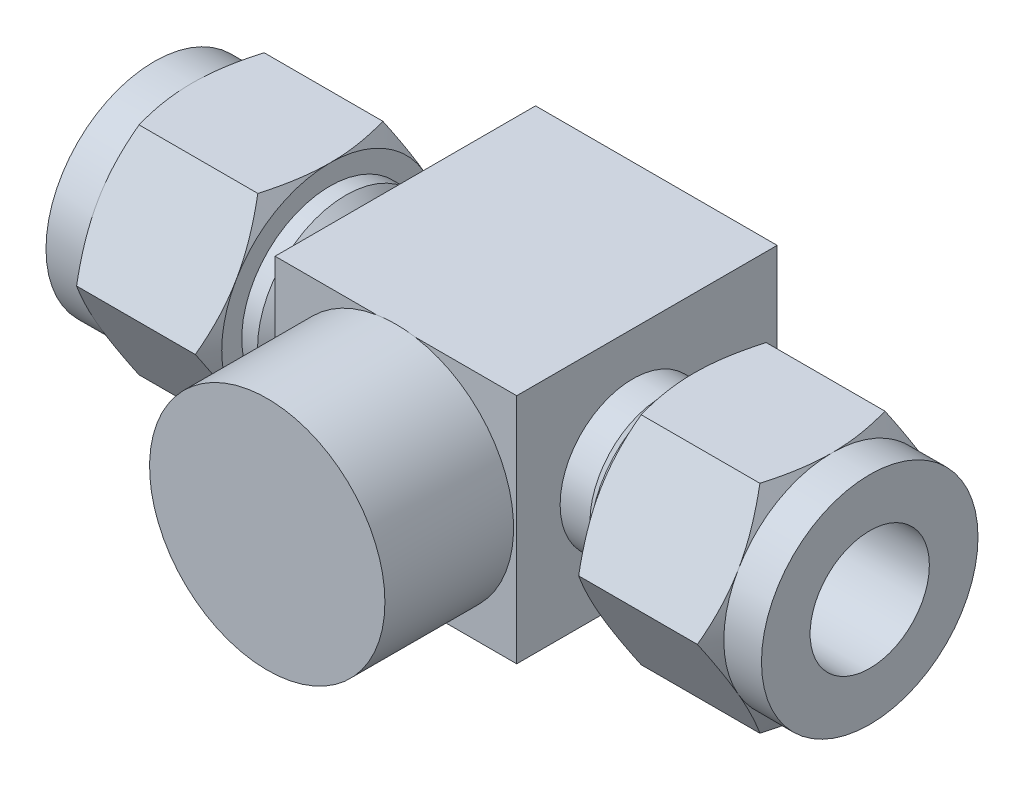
ISO-10303-21;
HEADER;
FILE_DESCRIPTION(('STEP AP214'),'2;1');
FILE_NAME('part.step','',(''),(''),'','','');
FILE_SCHEMA(('AUTOMOTIVE_DESIGN { 1 0 10303 214 1 1 1 1 }'));
ENDSEC;
DATA;
#1=APPLICATION_CONTEXT('core data for automotive mechanical design processes');
#2=APPLICATION_PROTOCOL_DEFINITION('international standard','automotive_design',2000,#1);
#3=PRODUCT_CONTEXT('',#1,'mechanical');
#4=PRODUCT('Part','Part','',(#3));
#5=PRODUCT_RELATED_PRODUCT_CATEGORY('part','',(#4));
#6=PRODUCT_DEFINITION_FORMATION('','',#4);
#7=PRODUCT_DEFINITION_CONTEXT('part definition',#1,'design');
#8=PRODUCT_DEFINITION('design','',#6,#7);
#9=PRODUCT_DEFINITION_SHAPE('','',#8);
#10=(LENGTH_UNIT() NAMED_UNIT(*) SI_UNIT(.MILLI.,.METRE.));
#11=(NAMED_UNIT(*) PLANE_ANGLE_UNIT() SI_UNIT($,.RADIAN.));
#12=(NAMED_UNIT(*) SI_UNIT($,.STERADIAN.) SOLID_ANGLE_UNIT());
#13=UNCERTAINTY_MEASURE_WITH_UNIT(LENGTH_MEASURE(1.E-05),#10,'distance_accuracy_value','');
#14=(GEOMETRIC_REPRESENTATION_CONTEXT(3) GLOBAL_UNCERTAINTY_ASSIGNED_CONTEXT((#13)) GLOBAL_UNIT_ASSIGNED_CONTEXT((#10,
#11,#12)) REPRESENTATION_CONTEXT('',''));
#15=CARTESIAN_POINT('',(0.,0.,0.));
#16=DIRECTION('',(0.,0.,1.));
#17=DIRECTION('',(1.,0.,0.));
#18=AXIS2_PLACEMENT_3D('',#15,#16,#17);
#19=CARTESIAN_POINT('',(0.,0.,21.082));
#20=DIRECTION('',(0.,0.,-1.));
#21=DIRECTION('',(-1.,0.,0.));
#22=AXIS2_PLACEMENT_3D('',#19,#20,#21);
#23=PLANE('',#22);
#24=CARTESIAN_POINT('',(0.,0.,21.082));
#25=DIRECTION('',(0.,0.,1.));
#26=DIRECTION('',(1.,0.,0.));
#27=AXIS2_PLACEMENT_3D('',#24,#25,#26);
#28=CIRCLE('',#27,9.525);
#29=CARTESIAN_POINT('',(-1.55023256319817,9.398,21.082));
#30=VERTEX_POINT('',#29);
#31=CARTESIAN_POINT('',(-1.55023256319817,-9.398,21.082));
#32=VERTEX_POINT('',#31);
#33=EDGE_CURVE('E12',#30,#32,#28,.T.);
#34=ORIENTED_EDGE('',*,*,#33,.F.);
#35=DIRECTION('',(-1.,0.,0.));
#36=VECTOR('',#35,1.);
#37=CARTESIAN_POINT('',(-9.779,9.398,21.082));
#38=LINE('',#37,#36);
#39=CARTESIAN_POINT('',(-9.779,9.398,21.082));
#40=VERTEX_POINT('',#39);
#41=EDGE_CURVE('E270',#30,#40,#38,.T.);
#42=ORIENTED_EDGE('',*,*,#41,.T.);
#43=DIRECTION('',(0.,-1.,0.));
#44=VECTOR('',#43,1.);
#45=CARTESIAN_POINT('',(-9.779,-9.398,21.082));
#46=LINE('',#45,#44);
#47=CARTESIAN_POINT('',(-9.779,-9.398,21.082));
#48=VERTEX_POINT('',#47);
#49=EDGE_CURVE('E267',#40,#48,#46,.T.);
#50=ORIENTED_EDGE('',*,*,#49,.T.);
#51=DIRECTION('',(1.,0.,0.));
#52=VECTOR('',#51,1.);
#53=CARTESIAN_POINT('',(9.779,-9.398,21.082));
#54=LINE('',#53,#52);
#55=EDGE_CURVE('E294',#48,#32,#54,.T.);
#56=ORIENTED_EDGE('',*,*,#55,.T.);
#57=EDGE_LOOP('',(#34,#42,#50,#56));
#58=FACE_BOUND('',#57,.T.);
#59=ADVANCED_FACE('F47',(#58),#23,.F.);
#60=CARTESIAN_POINT('',(1.55023256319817,-9.398,21.082));
#61=VERTEX_POINT('',#60);
#62=CARTESIAN_POINT('',(1.55023256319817,9.398,21.082));
#63=VERTEX_POINT('',#62);
#64=EDGE_CURVE('E58',#61,#63,#28,.T.);
#65=ORIENTED_EDGE('',*,*,#64,.F.);
#66=CARTESIAN_POINT('',(9.779,-9.398,21.082));
#67=VERTEX_POINT('',#66);
#68=EDGE_CURVE('E293',#61,#67,#54,.T.);
#69=ORIENTED_EDGE('',*,*,#68,.T.);
#70=DIRECTION('',(0.,1.,0.));
#71=VECTOR('',#70,1.);
#72=CARTESIAN_POINT('',(9.779,9.398,21.082));
#73=LINE('',#72,#71);
#74=CARTESIAN_POINT('',(9.779,9.398,21.082));
#75=VERTEX_POINT('',#74);
#76=EDGE_CURVE('E264',#67,#75,#73,.T.);
#77=ORIENTED_EDGE('',*,*,#76,.T.);
#78=EDGE_CURVE('E260',#75,#63,#38,.T.);
#79=ORIENTED_EDGE('',*,*,#78,.T.);
#80=EDGE_LOOP('',(#65,#69,#77,#79));
#81=FACE_BOUND('',#80,.T.);
#82=ADVANCED_FACE('F262',(#81),#23,.F.);
#83=CARTESIAN_POINT('',(10.922,0.,11.684));
#84=DIRECTION('',(-1.,0.,0.));
#85=DIRECTION('',(0.,0.,1.));
#86=AXIS2_PLACEMENT_3D('',#83,#84,#85);
#87=CYLINDRICAL_SURFACE('',#86,5.88391);
#88=CARTESIAN_POINT('',(-12.192,0.,11.684));
#89=DIRECTION('',(1.,0.,0.));
#90=DIRECTION('',(0.,0.,-1.));
#91=AXIS2_PLACEMENT_3D('',#88,#89,#90);
#92=CIRCLE('',#91,5.88391);
#93=CARTESIAN_POINT('',(-12.192,0.,5.80009));
#94=VERTEX_POINT('',#93);
#95=EDGE_CURVE('E324',#94,#94,#92,.T.);
#96=ORIENTED_EDGE('',*,*,#95,.T.);
#97=EDGE_LOOP('',(#96));
#98=FACE_BOUND('',#97,.T.);
#99=CARTESIAN_POINT('',(-9.779,0.,11.684));
#100=DIRECTION('',(1.,0.,0.));
#101=DIRECTION('',(0.,0.,-1.));
#102=AXIS2_PLACEMENT_3D('',#99,#100,#101);
#103=CIRCLE('',#102,5.88391);
#104=CARTESIAN_POINT('',(-9.779,-0.231001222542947,5.80462628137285));
#105=VERTEX_POINT('',#104);
#106=CARTESIAN_POINT('',(-9.779,0.23100122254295,5.80462628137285));
#107=VERTEX_POINT('',#106);
#108=EDGE_CURVE('E323',#105,#107,#103,.F.);
#109=ORIENTED_EDGE('',*,*,#108,.T.);
#110=CARTESIAN_POINT('',(-9.779,0.,11.684));
#111=DIRECTION('',(-1.,0.,0.));
#112=DIRECTION('',(0.,0.0392598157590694,-0.999229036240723));
#113=AXIS2_PLACEMENT_3D('',#110,#111,#112);
#114=CIRCLE('',#113,5.88391);
#115=EDGE_CURVE('E808',#107,#105,#114,.T.);
#116=ORIENTED_EDGE('',*,*,#115,.T.);
#117=EDGE_LOOP('',(#109,#116));
#118=FACE_BOUND('',#117,.T.);
#119=ADVANCED_FACE('F766',(#98,#118),#87,.T.);
#120=CARTESIAN_POINT('',(9.779,0.231001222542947,5.80462628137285));
#121=CARTESIAN_POINT('',(9.779,0.,5.79555021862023));
#122=CARTESIAN_POINT('',(9.779,-0.231001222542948,5.80462628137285));
#123=B_SPLINE_CURVE_WITH_KNOTS('',2,(#120,#121,#122),.UNSPECIFIED.,.F.,.F.,(3,3),(0.,1.),.UNSPECIFIED.);
#124=CARTESIAN_POINT('',(9.779,0.231001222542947,5.80462628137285));
#125=VERTEX_POINT('',#124);
#126=CARTESIAN_POINT('',(9.779,-0.23100122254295,5.80462628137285));
#127=VERTEX_POINT('',#126);
#128=EDGE_CURVE('E317',#125,#127,#123,.T.);
#129=ORIENTED_EDGE('',*,*,#128,.F.);
#130=CARTESIAN_POINT('',(9.779,0.,11.684));
#131=DIRECTION('',(-1.,0.,0.));
#132=DIRECTION('',(0.,0.,1.));
#133=AXIS2_PLACEMENT_3D('',#130,#131,#132);
#134=CIRCLE('',#133,5.88391);
#135=EDGE_CURVE('E283',#125,#127,#134,.F.);
#136=ORIENTED_EDGE('',*,*,#135,.T.);
#137=EDGE_LOOP('',(#129,#136));
#138=FACE_BOUND('',#137,.T.);
#139=CARTESIAN_POINT('',(12.192,0.,11.684));
#140=DIRECTION('',(-1.,0.,0.));
#141=DIRECTION('',(0.,0.,1.));
#142=AXIS2_PLACEMENT_3D('',#139,#140,#141);
#143=CIRCLE('',#142,5.88391);
#144=CARTESIAN_POINT('',(12.192,0.,17.56791));
#145=VERTEX_POINT('',#144);
#146=EDGE_CURVE('E318',#145,#145,#143,.T.);
#147=ORIENTED_EDGE('',*,*,#146,.T.);
#148=EDGE_LOOP('',(#147));
#149=FACE_BOUND('',#148,.T.);
#150=ADVANCED_FACE('F784',(#138,#149),#87,.T.);
#151=CARTESIAN_POINT('',(9.779,0.,10.541));
#152=DIRECTION('',(-1.,0.,0.));
#153=DIRECTION('',(0.,0.,1.));
#154=AXIS2_PLACEMENT_3D('',#151,#152,#153);
#155=PLANE('',#154);
#156=ORIENTED_EDGE('',*,*,#135,.F.);
#157=ORIENTED_EDGE('',*,*,#128,.T.);
#158=EDGE_LOOP('',(#156,#157));
#159=FACE_BOUND('',#158,.T.);
#160=DIRECTION('',(0.,0.,-1.));
#161=VECTOR('',#160,1.);
#162=CARTESIAN_POINT('',(9.779,9.398,0.));
#163=LINE('',#162,#161);
#164=CARTESIAN_POINT('',(9.779,9.398,0.));
#165=VERTEX_POINT('',#164);
#166=EDGE_CURVE('E297',#75,#165,#163,.T.);
#167=ORIENTED_EDGE('',*,*,#166,.F.);
#168=ORIENTED_EDGE('',*,*,#76,.F.);
#169=DIRECTION('',(0.,0.,1.));
#170=VECTOR('',#169,1.);
#171=CARTESIAN_POINT('',(9.779,-9.398,17.56791));
#172=LINE('',#171,#170);
#173=CARTESIAN_POINT('',(9.779,-9.398,0.));
#174=VERTEX_POINT('',#173);
#175=EDGE_CURVE('E310',#174,#67,#172,.T.);
#176=ORIENTED_EDGE('',*,*,#175,.F.);
#177=DIRECTION('',(0.,-1.,0.));
#178=VECTOR('',#177,1.);
#179=CARTESIAN_POINT('',(9.779,-5.86577186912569,0.));
#180=LINE('',#179,#178);
#181=EDGE_CURVE('E315',#165,#174,#180,.T.);
#182=ORIENTED_EDGE('',*,*,#181,.F.);
#183=EDGE_LOOP('',(#167,#168,#176,#182));
#184=FACE_BOUND('',#183,.T.);
#185=ADVANCED_FACE('F779',(#159,#184),#155,.F.);
#186=CARTESIAN_POINT('',(-9.779,0.,10.541));
#187=DIRECTION('',(1.,0.,0.));
#188=DIRECTION('',(0.,0.,-1.));
#189=AXIS2_PLACEMENT_3D('',#186,#187,#188);
#190=PLANE('',#189);
#191=ORIENTED_EDGE('',*,*,#115,.F.);
#192=ORIENTED_EDGE('',*,*,#108,.F.);
#193=EDGE_LOOP('',(#191,#192));
#194=FACE_BOUND('',#193,.T.);
#195=DIRECTION('',(0.,0.,-1.));
#196=VECTOR('',#195,1.);
#197=CARTESIAN_POINT('',(-9.779,-9.398,0.));
#198=LINE('',#197,#196);
#199=CARTESIAN_POINT('',(-9.779,-9.398,0.));
#200=VERTEX_POINT('',#199);
#201=EDGE_CURVE('E304',#48,#200,#198,.T.);
#202=ORIENTED_EDGE('',*,*,#201,.F.);
#203=ORIENTED_EDGE('',*,*,#49,.F.);
#204=DIRECTION('',(0.,0.,1.));
#205=VECTOR('',#204,1.);
#206=CARTESIAN_POINT('',(-9.779,9.398,17.56791));
#207=LINE('',#206,#205);
#208=CARTESIAN_POINT('',(-9.779,9.398,0.));
#209=VERTEX_POINT('',#208);
#210=EDGE_CURVE('E302',#209,#40,#207,.T.);
#211=ORIENTED_EDGE('',*,*,#210,.F.);
#212=DIRECTION('',(0.,1.,0.));
#213=VECTOR('',#212,1.);
#214=CARTESIAN_POINT('',(-9.779,5.88391,0.));
#215=LINE('',#214,#213);
#216=EDGE_CURVE('E313',#200,#209,#215,.T.);
#217=ORIENTED_EDGE('',*,*,#216,.F.);
#218=EDGE_LOOP('',(#202,#203,#211,#217));
#219=FACE_BOUND('',#218,.T.);
#220=ADVANCED_FACE('F783',(#194,#219),#190,.F.);
#221=CARTESIAN_POINT('',(-28.956,0.,16.0655));
#222=DIRECTION('',(-1.,0.,0.));
#223=DIRECTION('',(0.,0.,1.));
#224=AXIS2_PLACEMENT_3D('',#221,#222,#223);
#225=PLANE('',#224);
#226=CARTESIAN_POINT('',(-28.956,0.,11.684));
#227=DIRECTION('',(-1.,0.,0.));
#228=DIRECTION('',(0.,0.,1.));
#229=AXIS2_PLACEMENT_3D('',#226,#227,#228);
#230=CIRCLE('',#229,4.82599999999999);
#231=CARTESIAN_POINT('',(-28.956,0.,16.51));
#232=VERTEX_POINT('',#231);
#233=EDGE_CURVE('E893',#232,#232,#230,.T.);
#234=ORIENTED_EDGE('',*,*,#233,.F.);
#235=EDGE_LOOP('',(#234));
#236=FACE_BOUND('',#235,.T.);
#237=CARTESIAN_POINT('',(-28.956,0.,11.684));
#238=DIRECTION('',(1.,0.,0.));
#239=DIRECTION('',(0.,0.,-1.));
#240=AXIS2_PLACEMENT_3D('',#237,#238,#239);
#241=CIRCLE('',#240,8.763);
#242=CARTESIAN_POINT('',(-28.956,0.,2.921));
#243=VERTEX_POINT('',#242);
#244=EDGE_CURVE('E834',#243,#243,#241,.T.);
#245=ORIENTED_EDGE('',*,*,#244,.F.);
#246=EDGE_LOOP('',(#245));
#247=FACE_BOUND('',#246,.T.);
#248=ADVANCED_FACE('F49',(#236,#247),#225,.T.);
#249=CARTESIAN_POINT('',(28.956,0.,16.0655));
#250=DIRECTION('',(1.,0.,0.));
#251=DIRECTION('',(0.,0.,-1.));
#252=AXIS2_PLACEMENT_3D('',#249,#250,#251);
#253=PLANE('',#252);
#254=CARTESIAN_POINT('',(28.956,0.,11.684));
#255=DIRECTION('',(1.,0.,0.));
#256=DIRECTION('',(0.,0.,-1.));
#257=AXIS2_PLACEMENT_3D('',#254,#255,#256);
#258=CIRCLE('',#257,4.82599999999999);
#259=CARTESIAN_POINT('',(28.956,0.,6.85800000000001));
#260=VERTEX_POINT('',#259);
#261=EDGE_CURVE('E904',#260,#260,#258,.T.);
#262=ORIENTED_EDGE('',*,*,#261,.F.);
#263=EDGE_LOOP('',(#262));
#264=FACE_BOUND('',#263,.T.);
#265=CARTESIAN_POINT('',(28.956,0.,11.684));
#266=DIRECTION('',(-1.,0.,0.));
#267=DIRECTION('',(0.,0.,1.));
#268=AXIS2_PLACEMENT_3D('',#265,#266,#267);
#269=CIRCLE('',#268,8.763);
#270=CARTESIAN_POINT('',(28.956,0.,20.447));
#271=VERTEX_POINT('',#270);
#272=EDGE_CURVE('E927',#271,#271,#269,.T.);
#273=ORIENTED_EDGE('',*,*,#272,.F.);
#274=EDGE_LOOP('',(#273));
#275=FACE_BOUND('',#274,.T.);
#276=ADVANCED_FACE('F921',(#264,#275),#253,.T.);
#277=CARTESIAN_POINT('',(-20.32,0.,11.684));
#278=DIRECTION('',(1.,0.,0.));
#279=DIRECTION('',(0.,0.,-1.));
#280=AXIS2_PLACEMENT_3D('',#277,#278,#279);
#281=CYLINDRICAL_SURFACE('',#280,8.763);
#282=CARTESIAN_POINT('',(-25.908,0.,11.684));
#283=DIRECTION('',(1.,0.,0.));
#284=DIRECTION('',(0.,0.,-1.));
#285=AXIS2_PLACEMENT_3D('',#282,#283,#284);
#286=CIRCLE('',#285,8.763);
#287=CARTESIAN_POINT('',(-25.908,-8.763,11.684));
#288=VERTEX_POINT('',#287);
#289=CARTESIAN_POINT('',(-25.908,-4.3815,19.272980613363));
#290=VERTEX_POINT('',#289);
#291=EDGE_CURVE('E930',#288,#290,#286,.F.);
#292=ORIENTED_EDGE('',*,*,#291,.T.);
#293=CARTESIAN_POINT('',(-25.908,0.,11.684));
#294=DIRECTION('',(1.,0.,0.));
#295=DIRECTION('',(0.,0.,-1.));
#296=AXIS2_PLACEMENT_3D('',#293,#294,#295);
#297=CIRCLE('',#296,8.763);
#298=CARTESIAN_POINT('',(-25.908,4.3815,19.272980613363));
#299=VERTEX_POINT('',#298);
#300=EDGE_CURVE('E1288',#290,#299,#297,.F.);
#301=ORIENTED_EDGE('',*,*,#300,.T.);
#302=CARTESIAN_POINT('',(-25.908,0.,11.684));
#303=DIRECTION('',(1.,0.,0.));
#304=DIRECTION('',(0.,0.,-1.));
#305=AXIS2_PLACEMENT_3D('',#302,#303,#304);
#306=CIRCLE('',#305,8.763);
#307=CARTESIAN_POINT('',(-25.908,8.763,11.684));
#308=VERTEX_POINT('',#307);
#309=EDGE_CURVE('E1293',#299,#308,#306,.F.);
#310=ORIENTED_EDGE('',*,*,#309,.T.);
#311=CARTESIAN_POINT('',(-25.908,0.,11.684));
#312=DIRECTION('',(1.,0.,0.));
#313=DIRECTION('',(0.,0.,-1.));
#314=AXIS2_PLACEMENT_3D('',#311,#312,#313);
#315=CIRCLE('',#314,8.763);
#316=CARTESIAN_POINT('',(-25.908,4.3815,4.09501938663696));
#317=VERTEX_POINT('',#316);
#318=EDGE_CURVE('E1296',#308,#317,#315,.F.);
#319=ORIENTED_EDGE('',*,*,#318,.T.);
#320=CARTESIAN_POINT('',(-25.908,0.,11.684));
#321=DIRECTION('',(1.,0.,0.));
#322=DIRECTION('',(0.,0.,-1.));
#323=AXIS2_PLACEMENT_3D('',#320,#321,#322);
#324=CIRCLE('',#323,8.76300000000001);
#325=CARTESIAN_POINT('',(-25.908,-4.3815,4.09501938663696));
#326=VERTEX_POINT('',#325);
#327=EDGE_CURVE('E1283',#317,#326,#324,.F.);
#328=ORIENTED_EDGE('',*,*,#327,.T.);
#329=CARTESIAN_POINT('',(-25.908,0.,11.684));
#330=DIRECTION('',(1.,0.,0.));
#331=DIRECTION('',(0.,0.,-1.));
#332=AXIS2_PLACEMENT_3D('',#329,#330,#331);
#333=CIRCLE('',#332,8.763);
#334=EDGE_CURVE('E937',#326,#288,#333,.F.);
#335=ORIENTED_EDGE('',*,*,#334,.T.);
#336=EDGE_LOOP('',(#292,#301,#310,#319,#328,#335));
#337=FACE_BOUND('',#336,.T.);
#338=ORIENTED_EDGE('',*,*,#244,.T.);
#339=EDGE_LOOP('',(#338));
#340=FACE_BOUND('',#339,.T.);
#341=ADVANCED_FACE('F924',(#337,#340),#281,.T.);
#342=CARTESIAN_POINT('',(20.32,0.,11.684));
#343=DIRECTION('',(-1.,0.,0.));
#344=DIRECTION('',(0.,0.,1.));
#345=AXIS2_PLACEMENT_3D('',#342,#343,#344);
#346=CYLINDRICAL_SURFACE('',#345,8.763);
#347=CARTESIAN_POINT('',(25.908,0.,11.684));
#348=DIRECTION('',(-1.,0.,0.));
#349=DIRECTION('',(0.,0.,-1.));
#350=AXIS2_PLACEMENT_3D('',#347,#348,#349);
#351=CIRCLE('',#350,8.763);
#352=CARTESIAN_POINT('',(25.908,8.76299999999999,11.684));
#353=VERTEX_POINT('',#352);
#354=CARTESIAN_POINT('',(25.908,4.3815,19.272980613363));
#355=VERTEX_POINT('',#354);
#356=EDGE_CURVE('E1300',#353,#355,#351,.F.);
#357=ORIENTED_EDGE('',*,*,#356,.T.);
#358=CARTESIAN_POINT('',(25.908,0.,11.684));
#359=DIRECTION('',(-1.,0.,0.));
#360=DIRECTION('',(0.,0.,-1.));
#361=AXIS2_PLACEMENT_3D('',#358,#359,#360);
#362=CIRCLE('',#361,8.763);
#363=CARTESIAN_POINT('',(25.908,-4.3815,19.272980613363));
#364=VERTEX_POINT('',#363);
#365=EDGE_CURVE('E1312',#355,#364,#362,.F.);
#366=ORIENTED_EDGE('',*,*,#365,.T.);
#367=CARTESIAN_POINT('',(25.908,0.,11.684));
#368=DIRECTION('',(-1.,0.,0.));
#369=DIRECTION('',(0.,0.,-1.));
#370=AXIS2_PLACEMENT_3D('',#367,#368,#369);
#371=CIRCLE('',#370,8.763);
#372=CARTESIAN_POINT('',(25.908,-8.763,11.684));
#373=VERTEX_POINT('',#372);
#374=EDGE_CURVE('E1317',#364,#373,#371,.F.);
#375=ORIENTED_EDGE('',*,*,#374,.T.);
#376=CARTESIAN_POINT('',(25.908,0.,11.684));
#377=DIRECTION('',(-1.,0.,0.));
#378=DIRECTION('',(0.,0.,-1.));
#379=AXIS2_PLACEMENT_3D('',#376,#377,#378);
#380=CIRCLE('',#379,8.763);
#381=CARTESIAN_POINT('',(25.908,-4.3815,4.09501938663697));
#382=VERTEX_POINT('',#381);
#383=EDGE_CURVE('E1320',#373,#382,#380,.F.);
#384=ORIENTED_EDGE('',*,*,#383,.T.);
#385=CARTESIAN_POINT('',(25.908,0.,11.684));
#386=DIRECTION('',(-1.,0.,0.));
#387=DIRECTION('',(0.,0.,-1.));
#388=AXIS2_PLACEMENT_3D('',#385,#386,#387);
#389=CIRCLE('',#388,8.763);
#390=CARTESIAN_POINT('',(25.908,4.3815,4.09501938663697));
#391=VERTEX_POINT('',#390);
#392=EDGE_CURVE('E1307',#382,#391,#389,.F.);
#393=ORIENTED_EDGE('',*,*,#392,.T.);
#394=CARTESIAN_POINT('',(25.908,0.,11.684));
#395=DIRECTION('',(-1.,0.,0.));
#396=DIRECTION('',(0.,0.,-1.));
#397=AXIS2_PLACEMENT_3D('',#394,#395,#396);
#398=CIRCLE('',#397,8.763);
#399=EDGE_CURVE('E1304',#391,#353,#398,.F.);
#400=ORIENTED_EDGE('',*,*,#399,.T.);
#401=EDGE_LOOP('',(#357,#366,#375,#384,#393,#400));
#402=FACE_BOUND('',#401,.T.);
#403=ORIENTED_EDGE('',*,*,#272,.T.);
#404=EDGE_LOOP('',(#403));
#405=FACE_BOUND('',#404,.T.);
#406=ADVANCED_FACE('F1610',(#402,#405),#346,.T.);
#407=CARTESIAN_POINT('',(-25.908,0.,11.684));
#408=DIRECTION('',(1.,0.,0.));
#409=DIRECTION('',(0.,0.,-1.));
#410=AXIS2_PLACEMENT_3D('',#407,#408,#409);
#411=CONICAL_SURFACE('',#410,8.763,1.0471975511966);
#412=CARTESIAN_POINT('',(-25.908,-4.3815,19.272980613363));
#413=CARTESIAN_POINT('',(-25.9080358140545,-4.56747009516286,19.1656107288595));
#414=CARTESIAN_POINT('',(-25.9034436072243,-4.75343123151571,19.0582460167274));
#415=CARTESIAN_POINT('',(-25.885269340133,-5.12498836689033,18.8437274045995));
#416=CARTESIAN_POINT('',(-25.8716890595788,-5.31058443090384,18.7365734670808));
#417=CARTESIAN_POINT('',(-25.8358942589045,-5.68021261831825,18.523168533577));
#418=CARTESIAN_POINT('',(-25.8137232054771,-5.86424792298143,18.4169157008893));
#419=CARTESIAN_POINT('',(-25.7612237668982,-6.23144172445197,18.2049162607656));
#420=CARTESIAN_POINT('',(-25.7308951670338,-6.4146001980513,18.0991696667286));
#421=CARTESIAN_POINT('',(-25.6286099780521,-6.96200116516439,17.7831275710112));
#422=CARTESIAN_POINT('',(-25.5453043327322,-7.32465343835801,17.5737501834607));
#423=CARTESIAN_POINT('',(-25.3531802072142,-8.04683933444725,17.1567959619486));
#424=CARTESIAN_POINT('',(-25.2442343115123,-8.40634776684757,16.9492336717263));
#425=CARTESIAN_POINT('',(-25.1253204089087,-8.763,16.7433204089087));
#426=B_SPLINE_CURVE_WITH_KNOTS('',3,(#412,#413,#414,#415,#416,#417,#418,#419,#420,#421,#422,
#423,#424,#425),.UNSPECIFIED.,.F.,.F.,(4,2,2,2,2,2,4),(0.,0.644153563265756,1.28817961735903,
1.92898877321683,2.56981479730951,3.84978725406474,5.13625990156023),.UNSPECIFIED.);
#427=CARTESIAN_POINT('',(-25.1253204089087,-8.763,16.7433204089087));
#428=VERTEX_POINT('',#427);
#429=EDGE_CURVE('E963',#290,#428,#426,.T.);
#430=ORIENTED_EDGE('',*,*,#429,.F.);
#431=ORIENTED_EDGE('',*,*,#291,.F.);
#432=CARTESIAN_POINT('',(-25.1253204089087,-8.763,16.7433204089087));
#433=CARTESIAN_POINT('',(-25.2442343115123,-8.763,16.3314938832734));
#434=CARTESIAN_POINT('',(-25.3531802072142,-8.763,15.9163693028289));
#435=CARTESIAN_POINT('',(-25.5453043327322,-8.763,15.0824608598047));
#436=CARTESIAN_POINT('',(-25.6286099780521,-8.763,14.6637060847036));
#437=CARTESIAN_POINT('',(-25.7308951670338,-8.763,14.0316218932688));
#438=CARTESIAN_POINT('',(-25.7612237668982,-8.763,13.8201287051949));
#439=CARTESIAN_POINT('',(-25.8137232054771,-8.763,13.3961298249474));
#440=CARTESIAN_POINT('',(-25.8358942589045,-8.763,13.183624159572));
#441=CARTESIAN_POINT('',(-25.8716890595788,-8.763,12.7568142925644));
#442=CARTESIAN_POINT('',(-25.885269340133,-8.763,12.542506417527));
#443=CARTESIAN_POINT('',(-25.9034436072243,-8.763,12.1134691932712));
#444=CARTESIAN_POINT('',(-25.9080358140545,-8.763,11.898739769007));
#445=CARTESIAN_POINT('',(-25.908,-8.76299999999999,11.684));
#446=B_SPLINE_CURVE_WITH_KNOTS('',3,(#432,#433,#434,#435,#436,#437,#438,#439,#440,#441,#442,
#443,#444,#445),.UNSPECIFIED.,.F.,.F.,(4,2,2,2,2,2,4),(0.,1.2864726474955,2.56644510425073,
3.2072711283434,3.8480802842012,4.49210633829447,5.13625990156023),.UNSPECIFIED.);
#447=EDGE_CURVE('E1328',#428,#288,#446,.T.);
#448=ORIENTED_EDGE('',*,*,#447,.F.);
#449=EDGE_LOOP('',(#430,#431,#448));
#450=FACE_BOUND('',#449,.T.);
#451=ADVANCED_FACE('F981',(#450),#411,.T.);
#452=CARTESIAN_POINT('',(-25.908,0.,11.684));
#453=DIRECTION('',(1.,0.,0.));
#454=DIRECTION('',(0.,0.,-1.));
#455=AXIS2_PLACEMENT_3D('',#452,#453,#454);
#456=CONICAL_SURFACE('',#455,8.76299999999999,1.0471975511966);
#457=ORIENTED_EDGE('',*,*,#334,.F.);
#458=CARTESIAN_POINT('',(-25.1253204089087,-8.763,6.62467959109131));
#459=CARTESIAN_POINT('',(-25.2442343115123,-8.40634776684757,6.41876632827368));
#460=CARTESIAN_POINT('',(-25.3531802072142,-8.04683933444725,6.21120403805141));
#461=CARTESIAN_POINT('',(-25.5453043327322,-7.324653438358,5.79424981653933));
#462=CARTESIAN_POINT('',(-25.6286099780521,-6.96200116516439,5.58487242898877));
#463=CARTESIAN_POINT('',(-25.7308951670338,-6.4146001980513,5.26883033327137));
#464=CARTESIAN_POINT('',(-25.7612237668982,-6.23144172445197,5.16308373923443));
#465=CARTESIAN_POINT('',(-25.8137232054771,-5.86424792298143,4.95108429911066));
#466=CARTESIAN_POINT('',(-25.8358942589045,-5.68021261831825,4.84483146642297));
#467=CARTESIAN_POINT('',(-25.8716890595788,-5.31058443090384,4.63142653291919));
#468=CARTESIAN_POINT('',(-25.885269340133,-5.12498836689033,4.52427259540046));
#469=CARTESIAN_POINT('',(-25.9034436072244,-4.75343123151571,4.30975398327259));
#470=CARTESIAN_POINT('',(-25.9080358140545,-4.56747009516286,4.20238927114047));
#471=CARTESIAN_POINT('',(-25.908,-4.3815,4.09501938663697));
#472=B_SPLINE_CURVE_WITH_KNOTS('',3,(#458,#459,#460,#461,#462,#463,#464,#465,#466,#467,#468,
#469,#470,#471),.UNSPECIFIED.,.F.,.F.,(4,2,2,2,2,2,4),(0.,1.2864726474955,2.56644510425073,
3.2072711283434,3.84808028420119,4.49210633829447,5.13625990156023),.UNSPECIFIED.);
#473=CARTESIAN_POINT('',(-25.1253204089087,-8.763,6.62467959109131));
#474=VERTEX_POINT('',#473);
#475=EDGE_CURVE('E1458',#474,#326,#472,.T.);
#476=ORIENTED_EDGE('',*,*,#475,.F.);
#477=CARTESIAN_POINT('',(-25.908,-8.76299999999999,11.684));
#478=CARTESIAN_POINT('',(-25.9080358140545,-8.76299999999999,11.469260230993));
#479=CARTESIAN_POINT('',(-25.9034436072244,-8.76299999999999,11.2545308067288));
#480=CARTESIAN_POINT('',(-25.885269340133,-8.76299999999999,10.825493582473));
#481=CARTESIAN_POINT('',(-25.8716890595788,-8.76299999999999,10.6111857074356));
#482=CARTESIAN_POINT('',(-25.8358942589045,-8.76299999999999,10.184375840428));
#483=CARTESIAN_POINT('',(-25.8137232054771,-8.76299999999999,9.97187017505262));
#484=CARTESIAN_POINT('',(-25.7612237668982,-8.76299999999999,9.54787129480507));
#485=CARTESIAN_POINT('',(-25.7308951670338,-8.76299999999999,9.33637810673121));
#486=CARTESIAN_POINT('',(-25.6286099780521,-8.76299999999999,8.7042939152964));
#487=CARTESIAN_POINT('',(-25.5453043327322,-8.76299999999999,8.28553914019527));
#488=CARTESIAN_POINT('',(-25.3531802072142,-8.76299999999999,7.45163069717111));
#489=CARTESIAN_POINT('',(-25.2442343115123,-8.76299999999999,7.03650611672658));
#490=CARTESIAN_POINT('',(-25.1253204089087,-8.76299999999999,6.62467959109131));
#491=B_SPLINE_CURVE_WITH_KNOTS('',3,(#477,#478,#479,#480,#481,#482,#483,#484,#485,#486,#487,
#488,#489,#490),.UNSPECIFIED.,.F.,.F.,(4,2,2,2,2,2,4),(0.,0.644153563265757,1.28817961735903,
1.92898877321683,2.56981479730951,3.84978725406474,5.13625990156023),.UNSPECIFIED.);
#492=EDGE_CURVE('E971',#288,#474,#491,.T.);
#493=ORIENTED_EDGE('',*,*,#492,.F.);
#494=EDGE_LOOP('',(#457,#476,#493));
#495=FACE_BOUND('',#494,.T.);
#496=ADVANCED_FACE('F1634',(#495),#456,.T.);
#497=CARTESIAN_POINT('',(-25.908,0.,11.684));
#498=DIRECTION('',(1.,0.,0.));
#499=DIRECTION('',(0.,0.,-1.));
#500=AXIS2_PLACEMENT_3D('',#497,#498,#499);
#501=CONICAL_SURFACE('',#500,8.763,1.0471975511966);
#502=ORIENTED_EDGE('',*,*,#327,.F.);
#503=CARTESIAN_POINT('',(-25.1253204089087,0.,1.56535918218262));
#504=CARTESIAN_POINT('',(-25.2442343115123,0.356652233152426,1.77127244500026));
#505=CARTESIAN_POINT('',(-25.3531802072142,0.716160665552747,1.97883473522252));
#506=CARTESIAN_POINT('',(-25.5453043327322,1.43834656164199,2.3957889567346));
#507=CARTESIAN_POINT('',(-25.6286099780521,1.80099883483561,2.60516634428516));
#508=CARTESIAN_POINT('',(-25.7308951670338,2.3483998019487,2.92120844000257));
#509=CARTESIAN_POINT('',(-25.7612237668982,2.53155827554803,3.0269550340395));
#510=CARTESIAN_POINT('',(-25.8137232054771,2.89875207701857,3.23895447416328));
#511=CARTESIAN_POINT('',(-25.8358942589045,3.08278738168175,3.34520730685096));
#512=CARTESIAN_POINT('',(-25.8716890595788,3.45241556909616,3.55861224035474));
#513=CARTESIAN_POINT('',(-25.885269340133,3.63801163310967,3.66576617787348));
#514=CARTESIAN_POINT('',(-25.9034436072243,4.00956876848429,3.88028479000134));
#515=CARTESIAN_POINT('',(-25.9080358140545,4.19552990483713,3.98764950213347));
#516=CARTESIAN_POINT('',(-25.908,4.3815,4.09501938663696));
#517=B_SPLINE_CURVE_WITH_KNOTS('',3,(#503,#504,#505,#506,#507,#508,#509,#510,#511,#512,#513,
#514,#515,#516),.UNSPECIFIED.,.F.,.F.,(4,2,2,2,2,2,4),(0.,1.2864726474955,2.56644510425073,
3.2072711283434,3.8480802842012,4.49210633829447,5.13625990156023),.UNSPECIFIED.);
#518=CARTESIAN_POINT('',(-25.1253204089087,0.,1.56535918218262));
#519=VERTEX_POINT('',#518);
#520=EDGE_CURVE('E1332',#519,#317,#517,.T.);
#521=ORIENTED_EDGE('',*,*,#520,.F.);
#522=CARTESIAN_POINT('',(-25.908,-4.3815,4.09501938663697));
#523=CARTESIAN_POINT('',(-25.9080358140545,-4.19552990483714,3.98764950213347));
#524=CARTESIAN_POINT('',(-25.9034436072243,-4.00956876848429,3.88028479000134));
#525=CARTESIAN_POINT('',(-25.885269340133,-3.63801163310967,3.66576617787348));
#526=CARTESIAN_POINT('',(-25.8716890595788,-3.45241556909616,3.55861224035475));
#527=CARTESIAN_POINT('',(-25.8358942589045,-3.08278738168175,3.34520730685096));
#528=CARTESIAN_POINT('',(-25.8137232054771,-2.89875207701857,3.23895447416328));
#529=CARTESIAN_POINT('',(-25.7612237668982,-2.53155827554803,3.0269550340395));
#530=CARTESIAN_POINT('',(-25.7308951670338,-2.3483998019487,2.92120844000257));
#531=CARTESIAN_POINT('',(-25.6286099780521,-1.80099883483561,2.60516634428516));
#532=CARTESIAN_POINT('',(-25.5453043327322,-1.438346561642,2.3957889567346));
#533=CARTESIAN_POINT('',(-25.3531802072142,-0.716160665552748,1.97883473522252));
#534=CARTESIAN_POINT('',(-25.2442343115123,-0.356652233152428,1.77127244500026));
#535=CARTESIAN_POINT('',(-25.1253204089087,0.,1.56535918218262));
#536=B_SPLINE_CURVE_WITH_KNOTS('',3,(#522,#523,#524,#525,#526,#527,#528,#529,#530,#531,#532,
#533,#534,#535),.UNSPECIFIED.,.F.,.F.,(4,2,2,2,2,2,4),(0.,0.644153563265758,1.28817961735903,
1.92898877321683,2.56981479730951,3.84978725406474,5.13625990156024),.UNSPECIFIED.);
#537=EDGE_CURVE('E1090',#326,#519,#536,.T.);
#538=ORIENTED_EDGE('',*,*,#537,.F.);
#539=EDGE_LOOP('',(#502,#521,#538));
#540=FACE_BOUND('',#539,.T.);
#541=ADVANCED_FACE('F1646',(#540),#501,.T.);
#542=CARTESIAN_POINT('',(-25.908,0.,11.684));
#543=DIRECTION('',(1.,0.,0.));
#544=DIRECTION('',(0.,0.,-1.));
#545=AXIS2_PLACEMENT_3D('',#542,#543,#544);
#546=CONICAL_SURFACE('',#545,8.763,1.0471975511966);
#547=CARTESIAN_POINT('',(-25.908,4.3815,19.272980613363));
#548=CARTESIAN_POINT('',(-25.9080358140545,4.19552990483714,19.3803504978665));
#549=CARTESIAN_POINT('',(-25.9034436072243,4.00956876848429,19.4877152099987));
#550=CARTESIAN_POINT('',(-25.885269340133,3.63801163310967,19.7022338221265));
#551=CARTESIAN_POINT('',(-25.8716890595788,3.45241556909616,19.8093877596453));
#552=CARTESIAN_POINT('',(-25.8358942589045,3.08278738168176,20.022792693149));
#553=CARTESIAN_POINT('',(-25.8137232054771,2.89875207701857,20.1290455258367));
#554=CARTESIAN_POINT('',(-25.7612237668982,2.53155827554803,20.3410449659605));
#555=CARTESIAN_POINT('',(-25.7308951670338,2.3483998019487,20.4467915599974));
#556=CARTESIAN_POINT('',(-25.6286099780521,1.80099883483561,20.7628336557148));
#557=CARTESIAN_POINT('',(-25.5453043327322,1.438346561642,20.9722110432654));
#558=CARTESIAN_POINT('',(-25.3531802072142,0.716160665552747,21.3891652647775));
#559=CARTESIAN_POINT('',(-25.2442343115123,0.356652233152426,21.5967275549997));
#560=CARTESIAN_POINT('',(-25.1253204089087,0.,21.8026408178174));
#561=B_SPLINE_CURVE_WITH_KNOTS('',3,(#547,#548,#549,#550,#551,#552,#553,#554,#555,#556,#557,
#558,#559,#560),.UNSPECIFIED.,.F.,.F.,(4,2,2,2,2,2,4),(0.,0.644153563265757,1.28817961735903,
1.92898877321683,2.5698147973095,3.84978725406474,5.13625990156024),.UNSPECIFIED.);
#562=CARTESIAN_POINT('',(-25.1253204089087,0.,21.8026408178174));
#563=VERTEX_POINT('',#562);
#564=EDGE_CURVE('E1336',#299,#563,#561,.T.);
#565=ORIENTED_EDGE('',*,*,#564,.F.);
#566=ORIENTED_EDGE('',*,*,#300,.F.);
#567=CARTESIAN_POINT('',(-25.1253204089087,0.,21.8026408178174));
#568=CARTESIAN_POINT('',(-25.2442343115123,-0.356652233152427,21.5967275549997));
#569=CARTESIAN_POINT('',(-25.3531802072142,-0.716160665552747,21.3891652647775));
#570=CARTESIAN_POINT('',(-25.5453043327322,-1.43834656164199,20.9722110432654));
#571=CARTESIAN_POINT('',(-25.6286099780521,-1.80099883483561,20.7628336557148));
#572=CARTESIAN_POINT('',(-25.7308951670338,-2.3483998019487,20.4467915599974));
#573=CARTESIAN_POINT('',(-25.7612237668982,-2.53155827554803,20.3410449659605));
#574=CARTESIAN_POINT('',(-25.8137232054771,-2.89875207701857,20.1290455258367));
#575=CARTESIAN_POINT('',(-25.8358942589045,-3.08278738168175,20.022792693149));
#576=CARTESIAN_POINT('',(-25.8716890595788,-3.45241556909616,19.8093877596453));
#577=CARTESIAN_POINT('',(-25.885269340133,-3.63801163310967,19.7022338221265));
#578=CARTESIAN_POINT('',(-25.9034436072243,-4.00956876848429,19.4877152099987));
#579=CARTESIAN_POINT('',(-25.9080358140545,-4.19552990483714,19.3803504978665));
#580=CARTESIAN_POINT('',(-25.908,-4.3815,19.272980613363));
#581=B_SPLINE_CURVE_WITH_KNOTS('',3,(#567,#568,#569,#570,#571,#572,#573,#574,#575,#576,#577,
#578,#579,#580),.UNSPECIFIED.,.F.,.F.,(4,2,2,2,2,2,4),(0.,1.2864726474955,2.56644510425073,
3.2072711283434,3.8480802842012,4.49210633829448,5.13625990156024),.UNSPECIFIED.);
#582=EDGE_CURVE('E942',#563,#290,#581,.T.);
#583=ORIENTED_EDGE('',*,*,#582,.F.);
#584=EDGE_LOOP('',(#565,#566,#583));
#585=FACE_BOUND('',#584,.T.);
#586=ADVANCED_FACE('F1376',(#585),#546,.T.);
#587=CARTESIAN_POINT('',(-25.908,0.,11.684));
#588=DIRECTION('',(1.,0.,0.));
#589=DIRECTION('',(0.,0.,-1.));
#590=AXIS2_PLACEMENT_3D('',#587,#588,#589);
#591=CONICAL_SURFACE('',#590,8.763,1.0471975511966);
#592=CARTESIAN_POINT('',(-25.908,8.763,11.684));
#593=CARTESIAN_POINT('',(-25.9080358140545,8.763,11.898739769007));
#594=CARTESIAN_POINT('',(-25.9034436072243,8.763,12.1134691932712));
#595=CARTESIAN_POINT('',(-25.885269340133,8.763,12.542506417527));
#596=CARTESIAN_POINT('',(-25.8716890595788,8.763,12.7568142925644));
#597=CARTESIAN_POINT('',(-25.8358942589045,8.763,13.183624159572));
#598=CARTESIAN_POINT('',(-25.8137232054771,8.763,13.3961298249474));
#599=CARTESIAN_POINT('',(-25.7612237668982,8.763,13.8201287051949));
#600=CARTESIAN_POINT('',(-25.7308951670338,8.763,14.0316218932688));
#601=CARTESIAN_POINT('',(-25.6286099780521,8.763,14.6637060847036));
#602=CARTESIAN_POINT('',(-25.5453043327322,8.763,15.0824608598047));
#603=CARTESIAN_POINT('',(-25.3531802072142,8.763,15.9163693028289));
#604=CARTESIAN_POINT('',(-25.2442343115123,8.763,16.3314938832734));
#605=CARTESIAN_POINT('',(-25.1253204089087,8.763,16.7433204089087));
#606=B_SPLINE_CURVE_WITH_KNOTS('',3,(#592,#593,#594,#595,#596,#597,#598,#599,#600,#601,#602,
#603,#604,#605),.UNSPECIFIED.,.F.,.F.,(4,2,2,2,2,2,4),(0.,0.644153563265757,1.28817961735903,
1.92898877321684,2.56981479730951,3.84978725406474,5.13625990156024),.UNSPECIFIED.);
#607=CARTESIAN_POINT('',(-25.1253204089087,8.763,16.7433204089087));
#608=VERTEX_POINT('',#607);
#609=EDGE_CURVE('E384',#308,#608,#606,.T.);
#610=ORIENTED_EDGE('',*,*,#609,.F.);
#611=ORIENTED_EDGE('',*,*,#309,.F.);
#612=CARTESIAN_POINT('',(-25.1253204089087,8.763,16.7433204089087));
#613=CARTESIAN_POINT('',(-25.2442343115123,8.40634776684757,16.9492336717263));
#614=CARTESIAN_POINT('',(-25.3531802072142,8.04683933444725,17.1567959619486));
#615=CARTESIAN_POINT('',(-25.5453043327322,7.324653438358,17.5737501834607));
#616=CARTESIAN_POINT('',(-25.6286099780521,6.96200116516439,17.7831275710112));
#617=CARTESIAN_POINT('',(-25.7308951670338,6.4146001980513,18.0991696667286));
#618=CARTESIAN_POINT('',(-25.7612237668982,6.23144172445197,18.2049162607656));
#619=CARTESIAN_POINT('',(-25.8137232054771,5.86424792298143,18.4169157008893));
#620=CARTESIAN_POINT('',(-25.8358942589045,5.68021261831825,18.523168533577));
#621=CARTESIAN_POINT('',(-25.8716890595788,5.31058443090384,18.7365734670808));
#622=CARTESIAN_POINT('',(-25.885269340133,5.12498836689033,18.8437274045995));
#623=CARTESIAN_POINT('',(-25.9034436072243,4.75343123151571,19.0582460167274));
#624=CARTESIAN_POINT('',(-25.9080358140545,4.56747009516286,19.1656107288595));
#625=CARTESIAN_POINT('',(-25.908,4.3815,19.272980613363));
#626=B_SPLINE_CURVE_WITH_KNOTS('',3,(#612,#613,#614,#615,#616,#617,#618,#619,#620,#621,#622,
#623,#624,#625),.UNSPECIFIED.,.F.,.F.,(4,2,2,2,2,2,4),(0.,1.2864726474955,2.56644510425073,
3.2072711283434,3.8480802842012,4.49210633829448,5.13625990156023),.UNSPECIFIED.);
#627=EDGE_CURVE('E1384',#608,#299,#626,.T.);
#628=ORIENTED_EDGE('',*,*,#627,.F.);
#629=EDGE_LOOP('',(#610,#611,#628));
#630=FACE_BOUND('',#629,.T.);
#631=ADVANCED_FACE('F1371',(#630),#591,.T.);
#632=CARTESIAN_POINT('',(-25.908,0.,11.684));
#633=DIRECTION('',(1.,0.,0.));
#634=DIRECTION('',(0.,0.,-1.));
#635=AXIS2_PLACEMENT_3D('',#632,#633,#634);
#636=CONICAL_SURFACE('',#635,8.763,1.0471975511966);
#637=ORIENTED_EDGE('',*,*,#318,.F.);
#638=CARTESIAN_POINT('',(-25.1253204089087,8.763,6.62467959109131));
#639=CARTESIAN_POINT('',(-25.2442343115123,8.763,7.03650611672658));
#640=CARTESIAN_POINT('',(-25.3531802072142,8.763,7.45163069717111));
#641=CARTESIAN_POINT('',(-25.5453043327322,8.763,8.28553914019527));
#642=CARTESIAN_POINT('',(-25.6286099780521,8.763,8.70429391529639));
#643=CARTESIAN_POINT('',(-25.7308951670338,8.763,9.3363781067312));
#644=CARTESIAN_POINT('',(-25.7612237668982,8.763,9.54787129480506));
#645=CARTESIAN_POINT('',(-25.8137232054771,8.763,9.97187017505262));
#646=CARTESIAN_POINT('',(-25.8358942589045,8.763,10.184375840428));
#647=CARTESIAN_POINT('',(-25.8716890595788,8.763,10.6111857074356));
#648=CARTESIAN_POINT('',(-25.885269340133,8.763,10.825493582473));
#649=CARTESIAN_POINT('',(-25.9034436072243,8.763,11.2545308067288));
#650=CARTESIAN_POINT('',(-25.9080358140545,8.763,11.469260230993));
#651=CARTESIAN_POINT('',(-25.908,8.763,11.684));
#652=B_SPLINE_CURVE_WITH_KNOTS('',3,(#638,#639,#640,#641,#642,#643,#644,#645,#646,#647,#648,
#649,#650,#651),.UNSPECIFIED.,.F.,.F.,(4,2,2,2,2,2,4),(0.,1.2864726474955,2.56644510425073,
3.2072711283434,3.8480802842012,4.49210633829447,5.13625990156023),.UNSPECIFIED.);
#653=CARTESIAN_POINT('',(-25.1253204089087,8.763,6.62467959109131));
#654=VERTEX_POINT('',#653);
#655=EDGE_CURVE('E461',#654,#308,#652,.T.);
#656=ORIENTED_EDGE('',*,*,#655,.F.);
#657=CARTESIAN_POINT('',(-25.908,4.3815,4.09501938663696));
#658=CARTESIAN_POINT('',(-25.9080358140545,4.56747009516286,4.20238927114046));
#659=CARTESIAN_POINT('',(-25.9034436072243,4.75343123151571,4.30975398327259));
#660=CARTESIAN_POINT('',(-25.885269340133,5.12498836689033,4.52427259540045));
#661=CARTESIAN_POINT('',(-25.8716890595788,5.31058443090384,4.63142653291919));
#662=CARTESIAN_POINT('',(-25.8358942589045,5.68021261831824,4.84483146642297));
#663=CARTESIAN_POINT('',(-25.8137232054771,5.86424792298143,4.95108429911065));
#664=CARTESIAN_POINT('',(-25.7612237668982,6.23144172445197,5.16308373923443));
#665=CARTESIAN_POINT('',(-25.7308951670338,6.41460019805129,5.26883033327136));
#666=CARTESIAN_POINT('',(-25.6286099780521,6.96200116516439,5.58487242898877));
#667=CARTESIAN_POINT('',(-25.5453043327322,7.324653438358,5.79424981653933));
#668=CARTESIAN_POINT('',(-25.3531802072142,8.04683933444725,6.21120403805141));
#669=CARTESIAN_POINT('',(-25.2442343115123,8.40634776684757,6.41876632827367));
#670=CARTESIAN_POINT('',(-25.1253204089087,8.763,6.62467959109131));
#671=B_SPLINE_CURVE_WITH_KNOTS('',3,(#657,#658,#659,#660,#661,#662,#663,#664,#665,#666,#667,
#668,#669,#670),.UNSPECIFIED.,.F.,.F.,(4,2,2,2,2,2,4),(0.,0.644153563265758,1.28817961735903,
1.92898877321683,2.56981479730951,3.84978725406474,5.13625990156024),.UNSPECIFIED.);
#672=EDGE_CURVE('E1337',#317,#654,#671,.T.);
#673=ORIENTED_EDGE('',*,*,#672,.F.);
#674=EDGE_LOOP('',(#637,#656,#673));
#675=FACE_BOUND('',#674,.T.);
#676=ADVANCED_FACE('F1367',(#675),#636,.T.);
#677=CARTESIAN_POINT('',(25.908,0.,11.684));
#678=DIRECTION('',(-1.,0.,0.));
#679=DIRECTION('',(0.,-1.,0.));
#680=AXIS2_PLACEMENT_3D('',#677,#678,#679);
#681=CONICAL_SURFACE('',#680,8.763,1.0471975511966);
#682=CARTESIAN_POINT('',(25.908,4.3815,19.272980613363));
#683=CARTESIAN_POINT('',(25.9080358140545,4.56747009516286,19.1656107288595));
#684=CARTESIAN_POINT('',(25.9034436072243,4.75343123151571,19.0582460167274));
#685=CARTESIAN_POINT('',(25.885269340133,5.12498836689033,18.8437274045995));
#686=CARTESIAN_POINT('',(25.8716890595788,5.31058443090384,18.7365734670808));
#687=CARTESIAN_POINT('',(25.8358942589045,5.68021261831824,18.523168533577));
#688=CARTESIAN_POINT('',(25.8137232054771,5.86424792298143,18.4169157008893));
#689=CARTESIAN_POINT('',(25.7612237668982,6.23144172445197,18.2049162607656));
#690=CARTESIAN_POINT('',(25.7308951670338,6.41460019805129,18.0991696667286));
#691=CARTESIAN_POINT('',(25.6286099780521,6.96200116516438,17.7831275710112));
#692=CARTESIAN_POINT('',(25.5453043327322,7.324653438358,17.5737501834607));
#693=CARTESIAN_POINT('',(25.3531802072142,8.04683933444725,17.1567959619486));
#694=CARTESIAN_POINT('',(25.2442343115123,8.40634776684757,16.9492336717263));
#695=CARTESIAN_POINT('',(25.1253204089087,8.76299999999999,16.7433204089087));
#696=B_SPLINE_CURVE_WITH_KNOTS('',3,(#682,#683,#684,#685,#686,#687,#688,#689,#690,#691,#692,
#693,#694,#695),.UNSPECIFIED.,.F.,.F.,(4,2,2,2,2,2,4),(0.,0.644153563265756,1.28817961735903,
1.92898877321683,2.5698147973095,3.84978725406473,5.13625990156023),.UNSPECIFIED.);
#697=CARTESIAN_POINT('',(25.1253204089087,8.76299999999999,16.7433204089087));
#698=VERTEX_POINT('',#697);
#699=EDGE_CURVE('E443',#355,#698,#696,.T.);
#700=ORIENTED_EDGE('',*,*,#699,.F.);
#701=ORIENTED_EDGE('',*,*,#356,.F.);
#702=CARTESIAN_POINT('',(25.1253204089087,8.76299999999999,16.7433204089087));
#703=CARTESIAN_POINT('',(25.2442343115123,8.76299999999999,16.3314938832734));
#704=CARTESIAN_POINT('',(25.3531802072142,8.76299999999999,15.9163693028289));
#705=CARTESIAN_POINT('',(25.5453043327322,8.76299999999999,15.0824608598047));
#706=CARTESIAN_POINT('',(25.6286099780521,8.76299999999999,14.6637060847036));
#707=CARTESIAN_POINT('',(25.7308951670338,8.76299999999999,14.0316218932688));
#708=CARTESIAN_POINT('',(25.7612237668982,8.76299999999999,13.8201287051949));
#709=CARTESIAN_POINT('',(25.8137232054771,8.76299999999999,13.3961298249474));
#710=CARTESIAN_POINT('',(25.8358942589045,8.76299999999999,13.183624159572));
#711=CARTESIAN_POINT('',(25.8716890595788,8.76299999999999,12.7568142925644));
#712=CARTESIAN_POINT('',(25.885269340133,8.76299999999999,12.542506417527));
#713=CARTESIAN_POINT('',(25.9034436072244,8.76299999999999,12.1134691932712));
#714=CARTESIAN_POINT('',(25.9080358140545,8.76299999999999,11.898739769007));
#715=CARTESIAN_POINT('',(25.908,8.76299999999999,11.684));
#716=B_SPLINE_CURVE_WITH_KNOTS('',3,(#702,#703,#704,#705,#706,#707,#708,#709,#710,#711,#712,
#713,#714,#715),.UNSPECIFIED.,.F.,.F.,(4,2,2,2,2,2,4),(0.,1.2864726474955,2.56644510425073,
3.2072711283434,3.8480802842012,4.49210633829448,5.13625990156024),.UNSPECIFIED.);
#717=EDGE_CURVE('E699',#698,#353,#716,.T.);
#718=ORIENTED_EDGE('',*,*,#717,.F.);
#719=EDGE_LOOP('',(#700,#701,#718));
#720=FACE_BOUND('',#719,.T.);
#721=ADVANCED_FACE('F730',(#720),#681,.T.);
#722=CARTESIAN_POINT('',(25.908,0.,11.684));
#723=DIRECTION('',(-1.,0.,0.));
#724=DIRECTION('',(0.,-1.,0.));
#725=AXIS2_PLACEMENT_3D('',#722,#723,#724);
#726=CONICAL_SURFACE('',#725,8.76299999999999,1.0471975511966);
#727=ORIENTED_EDGE('',*,*,#399,.F.);
#728=CARTESIAN_POINT('',(25.1253204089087,8.763,6.62467959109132));
#729=CARTESIAN_POINT('',(25.2442343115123,8.40634776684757,6.41876632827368));
#730=CARTESIAN_POINT('',(25.3531802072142,8.04683933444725,6.21120403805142));
#731=CARTESIAN_POINT('',(25.5453043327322,7.324653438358,5.79424981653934));
#732=CARTESIAN_POINT('',(25.6286099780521,6.96200116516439,5.58487242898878));
#733=CARTESIAN_POINT('',(25.7308951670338,6.4146001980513,5.26883033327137));
#734=CARTESIAN_POINT('',(25.7612237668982,6.23144172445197,5.16308373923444));
#735=CARTESIAN_POINT('',(25.8137232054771,5.86424792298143,4.95108429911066));
#736=CARTESIAN_POINT('',(25.8358942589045,5.68021261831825,4.84483146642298));
#737=CARTESIAN_POINT('',(25.8716890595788,5.31058443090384,4.63142653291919));
#738=CARTESIAN_POINT('',(25.885269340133,5.12498836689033,4.52427259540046));
#739=CARTESIAN_POINT('',(25.9034436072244,4.75343123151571,4.3097539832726));
#740=CARTESIAN_POINT('',(25.9080358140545,4.56747009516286,4.20238927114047));
#741=CARTESIAN_POINT('',(25.908,4.3815,4.09501938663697));
#742=B_SPLINE_CURVE_WITH_KNOTS('',3,(#728,#729,#730,#731,#732,#733,#734,#735,#736,#737,#738,
#739,#740,#741),.UNSPECIFIED.,.F.,.F.,(4,2,2,2,2,2,4),(0.,1.2864726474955,2.56644510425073,
3.2072711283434,3.8480802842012,4.49210633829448,5.13625990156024),.UNSPECIFIED.);
#743=CARTESIAN_POINT('',(25.1253204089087,8.76299999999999,6.62467959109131));
#744=VERTEX_POINT('',#743);
#745=EDGE_CURVE('E709',#744,#391,#742,.T.);
#746=ORIENTED_EDGE('',*,*,#745,.F.);
#747=CARTESIAN_POINT('',(25.908,8.76299999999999,11.684));
#748=CARTESIAN_POINT('',(25.9080358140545,8.76299999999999,11.469260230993));
#749=CARTESIAN_POINT('',(25.9034436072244,8.76299999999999,11.2545308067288));
#750=CARTESIAN_POINT('',(25.885269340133,8.76299999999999,10.825493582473));
#751=CARTESIAN_POINT('',(25.8716890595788,8.76299999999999,10.6111857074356));
#752=CARTESIAN_POINT('',(25.8358942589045,8.76299999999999,10.184375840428));
#753=CARTESIAN_POINT('',(25.8137232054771,8.76299999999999,9.97187017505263));
#754=CARTESIAN_POINT('',(25.7612237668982,8.76299999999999,9.54787129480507));
#755=CARTESIAN_POINT('',(25.7308951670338,8.76299999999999,9.33637810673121));
#756=CARTESIAN_POINT('',(25.6286099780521,8.76299999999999,8.7042939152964));
#757=CARTESIAN_POINT('',(25.5453043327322,8.76299999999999,8.28553914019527));
#758=CARTESIAN_POINT('',(25.3531802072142,8.76299999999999,7.45163069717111));
#759=CARTESIAN_POINT('',(25.2442343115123,8.76299999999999,7.03650611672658));
#760=CARTESIAN_POINT('',(25.1253204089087,8.76299999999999,6.62467959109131));
#761=B_SPLINE_CURVE_WITH_KNOTS('',3,(#747,#748,#749,#750,#751,#752,#753,#754,#755,#756,#757,
#758,#759,#760),.UNSPECIFIED.,.F.,.F.,(4,2,2,2,2,2,4),(0.,0.644153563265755,1.28817961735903,
1.92898877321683,2.56981479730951,3.84978725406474,5.13625990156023),.UNSPECIFIED.);
#762=EDGE_CURVE('E700',#353,#744,#761,.T.);
#763=ORIENTED_EDGE('',*,*,#762,.F.);
#764=EDGE_LOOP('',(#727,#746,#763));
#765=FACE_BOUND('',#764,.T.);
#766=ADVANCED_FACE('F727',(#765),#726,.T.);
#767=CARTESIAN_POINT('',(25.908,0.,11.684));
#768=DIRECTION('',(-1.,0.,0.));
#769=DIRECTION('',(0.,-1.,0.));
#770=AXIS2_PLACEMENT_3D('',#767,#768,#769);
#771=CONICAL_SURFACE('',#770,8.763,1.0471975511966);
#772=ORIENTED_EDGE('',*,*,#392,.F.);
#773=CARTESIAN_POINT('',(25.1253204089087,0.,1.56535918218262));
#774=CARTESIAN_POINT('',(25.2442343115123,-0.35665223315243,1.77127244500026));
#775=CARTESIAN_POINT('',(25.3531802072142,-0.716160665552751,1.97883473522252));
#776=CARTESIAN_POINT('',(25.5453043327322,-1.438346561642,2.3957889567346));
#777=CARTESIAN_POINT('',(25.6286099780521,-1.80099883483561,2.60516634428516));
#778=CARTESIAN_POINT('',(25.7308951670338,-2.3483998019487,2.92120844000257));
#779=CARTESIAN_POINT('',(25.7612237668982,-2.53155827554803,3.0269550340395));
#780=CARTESIAN_POINT('',(25.8137232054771,-2.89875207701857,3.23895447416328));
#781=CARTESIAN_POINT('',(25.8358942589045,-3.08278738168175,3.34520730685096));
#782=CARTESIAN_POINT('',(25.8716890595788,-3.45241556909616,3.55861224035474));
#783=CARTESIAN_POINT('',(25.885269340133,-3.63801163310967,3.66576617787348));
#784=CARTESIAN_POINT('',(25.9034436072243,-4.00956876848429,3.88028479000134));
#785=CARTESIAN_POINT('',(25.9080358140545,-4.19552990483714,3.98764950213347));
#786=CARTESIAN_POINT('',(25.908,-4.3815,4.09501938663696));
#787=B_SPLINE_CURVE_WITH_KNOTS('',3,(#773,#774,#775,#776,#777,#778,#779,#780,#781,#782,#783,
#784,#785,#786),.UNSPECIFIED.,.F.,.F.,(4,2,2,2,2,2,4),(0.,1.2864726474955,2.56644510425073,
3.2072711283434,3.8480802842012,4.49210633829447,5.13625990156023),.UNSPECIFIED.);
#788=CARTESIAN_POINT('',(25.1253204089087,0.,1.56535918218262));
#789=VERTEX_POINT('',#788);
#790=EDGE_CURVE('E693',#789,#382,#787,.T.);
#791=ORIENTED_EDGE('',*,*,#790,.F.);
#792=CARTESIAN_POINT('',(25.908,4.3815,4.09501938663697));
#793=CARTESIAN_POINT('',(25.9080358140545,4.19552990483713,3.98764950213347));
#794=CARTESIAN_POINT('',(25.9034436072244,4.00956876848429,3.88028479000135));
#795=CARTESIAN_POINT('',(25.885269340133,3.63801163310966,3.66576617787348));
#796=CARTESIAN_POINT('',(25.8716890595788,3.45241556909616,3.55861224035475));
#797=CARTESIAN_POINT('',(25.8358942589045,3.08278738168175,3.34520730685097));
#798=CARTESIAN_POINT('',(25.8137232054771,2.89875207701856,3.23895447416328));
#799=CARTESIAN_POINT('',(25.7612237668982,2.53155827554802,3.0269550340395));
#800=CARTESIAN_POINT('',(25.7308951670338,2.3483998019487,2.92120844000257));
#801=CARTESIAN_POINT('',(25.6286099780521,1.8009988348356,2.60516634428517));
#802=CARTESIAN_POINT('',(25.5453043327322,1.43834656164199,2.3957889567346));
#803=CARTESIAN_POINT('',(25.3531802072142,0.716160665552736,1.97883473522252));
#804=CARTESIAN_POINT('',(25.2442343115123,0.356652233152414,1.77127244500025));
#805=CARTESIAN_POINT('',(25.1253204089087,0.,1.56535918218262));
#806=B_SPLINE_CURVE_WITH_KNOTS('',3,(#792,#793,#794,#795,#796,#797,#798,#799,#800,#801,#802,
#803,#804,#805),.UNSPECIFIED.,.F.,.F.,(4,2,2,2,2,2,4),(0.,0.644153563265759,1.28817961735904,
1.92898877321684,2.56981479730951,3.84978725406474,5.13625990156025),.UNSPECIFIED.);
#807=EDGE_CURVE('E694',#391,#789,#806,.T.);
#808=ORIENTED_EDGE('',*,*,#807,.F.);
#809=EDGE_LOOP('',(#772,#791,#808));
#810=FACE_BOUND('',#809,.T.);
#811=ADVANCED_FACE('F476',(#810),#771,.T.);
#812=CARTESIAN_POINT('',(25.908,0.,11.684));
#813=DIRECTION('',(-1.,0.,0.));
#814=DIRECTION('',(0.,-1.,0.));
#815=AXIS2_PLACEMENT_3D('',#812,#813,#814);
#816=CONICAL_SURFACE('',#815,8.763,1.0471975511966);
#817=CARTESIAN_POINT('',(25.908,-4.3815,19.272980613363));
#818=CARTESIAN_POINT('',(25.9080358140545,-4.19552990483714,19.3803504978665));
#819=CARTESIAN_POINT('',(25.9034436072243,-4.0095687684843,19.4877152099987));
#820=CARTESIAN_POINT('',(25.885269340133,-3.63801163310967,19.7022338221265));
#821=CARTESIAN_POINT('',(25.8716890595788,-3.45241556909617,19.8093877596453));
#822=CARTESIAN_POINT('',(25.8358942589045,-3.08278738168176,20.022792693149));
#823=CARTESIAN_POINT('',(25.8137232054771,-2.89875207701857,20.1290455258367));
#824=CARTESIAN_POINT('',(25.7612237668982,-2.53155827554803,20.3410449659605));
#825=CARTESIAN_POINT('',(25.7308951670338,-2.34839980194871,20.4467915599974));
#826=CARTESIAN_POINT('',(25.6286099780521,-1.80099883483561,20.7628336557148));
#827=CARTESIAN_POINT('',(25.5453043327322,-1.438346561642,20.9722110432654));
#828=CARTESIAN_POINT('',(25.3531802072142,-0.716160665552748,21.3891652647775));
#829=CARTESIAN_POINT('',(25.2442343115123,-0.356652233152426,21.5967275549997));
#830=CARTESIAN_POINT('',(25.1253204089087,0.,21.8026408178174));
#831=B_SPLINE_CURVE_WITH_KNOTS('',3,(#817,#818,#819,#820,#821,#822,#823,#824,#825,#826,#827,
#828,#829,#830),.UNSPECIFIED.,.F.,.F.,(4,2,2,2,2,2,4),(0.,0.644153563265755,1.28817961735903,
1.92898877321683,2.56981479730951,3.84978725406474,5.13625990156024),.UNSPECIFIED.);
#832=CARTESIAN_POINT('',(25.1253204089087,0.,21.8026408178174));
#833=VERTEX_POINT('',#832);
#834=EDGE_CURVE('E484',#364,#833,#831,.T.);
#835=ORIENTED_EDGE('',*,*,#834,.F.);
#836=ORIENTED_EDGE('',*,*,#365,.F.);
#837=CARTESIAN_POINT('',(25.1253204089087,0.,21.8026408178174));
#838=CARTESIAN_POINT('',(25.2442343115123,0.356652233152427,21.5967275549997));
#839=CARTESIAN_POINT('',(25.3531802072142,0.716160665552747,21.3891652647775));
#840=CARTESIAN_POINT('',(25.5453043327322,1.438346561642,20.9722110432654));
#841=CARTESIAN_POINT('',(25.6286099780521,1.80099883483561,20.7628336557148));
#842=CARTESIAN_POINT('',(25.7308951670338,2.3483998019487,20.4467915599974));
#843=CARTESIAN_POINT('',(25.7612237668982,2.53155827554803,20.3410449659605));
#844=CARTESIAN_POINT('',(25.8137232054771,2.89875207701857,20.1290455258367));
#845=CARTESIAN_POINT('',(25.8358942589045,3.08278738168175,20.022792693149));
#846=CARTESIAN_POINT('',(25.8716890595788,3.45241556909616,19.8093877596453));
#847=CARTESIAN_POINT('',(25.885269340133,3.63801163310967,19.7022338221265));
#848=CARTESIAN_POINT('',(25.9034436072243,4.00956876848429,19.4877152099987));
#849=CARTESIAN_POINT('',(25.9080358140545,4.19552990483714,19.3803504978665));
#850=CARTESIAN_POINT('',(25.908,4.3815,19.272980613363));
#851=B_SPLINE_CURVE_WITH_KNOTS('',3,(#837,#838,#839,#840,#841,#842,#843,#844,#845,#846,#847,
#848,#849,#850),.UNSPECIFIED.,.F.,.F.,(4,2,2,2,2,2,4),(0.,1.2864726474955,2.56644510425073,
3.2072711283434,3.8480802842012,4.49210633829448,5.13625990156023),.UNSPECIFIED.);
#852=EDGE_CURVE('E452',#833,#355,#851,.T.);
#853=ORIENTED_EDGE('',*,*,#852,.F.);
#854=EDGE_LOOP('',(#835,#836,#853));
#855=FACE_BOUND('',#854,.T.);
#856=ADVANCED_FACE('F470',(#855),#816,.T.);
#857=CARTESIAN_POINT('',(25.908,0.,11.684));
#858=DIRECTION('',(-1.,0.,0.));
#859=DIRECTION('',(0.,-1.,0.));
#860=AXIS2_PLACEMENT_3D('',#857,#858,#859);
#861=CONICAL_SURFACE('',#860,8.76299999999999,1.0471975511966);
#862=CARTESIAN_POINT('',(25.908,-8.763,11.684));
#863=CARTESIAN_POINT('',(25.9080358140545,-8.763,11.898739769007));
#864=CARTESIAN_POINT('',(25.9034436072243,-8.763,12.1134691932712));
#865=CARTESIAN_POINT('',(25.885269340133,-8.763,12.542506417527));
#866=CARTESIAN_POINT('',(25.8716890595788,-8.763,12.7568142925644));
#867=CARTESIAN_POINT('',(25.8358942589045,-8.763,13.183624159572));
#868=CARTESIAN_POINT('',(25.8137232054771,-8.763,13.3961298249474));
#869=CARTESIAN_POINT('',(25.7612237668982,-8.763,13.8201287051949));
#870=CARTESIAN_POINT('',(25.7308951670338,-8.763,14.0316218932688));
#871=CARTESIAN_POINT('',(25.6286099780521,-8.763,14.6637060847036));
#872=CARTESIAN_POINT('',(25.5453043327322,-8.763,15.0824608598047));
#873=CARTESIAN_POINT('',(25.3531802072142,-8.763,15.9163693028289));
#874=CARTESIAN_POINT('',(25.2442343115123,-8.763,16.3314938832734));
#875=CARTESIAN_POINT('',(25.1253204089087,-8.763,16.7433204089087));
#876=B_SPLINE_CURVE_WITH_KNOTS('',3,(#862,#863,#864,#865,#866,#867,#868,#869,#870,#871,#872,
#873,#874,#875),.UNSPECIFIED.,.F.,.F.,(4,2,2,2,2,2,4),(0.,0.644153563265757,1.28817961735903,
1.92898877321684,2.56981479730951,3.84978725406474,5.13625990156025),.UNSPECIFIED.);
#877=CARTESIAN_POINT('',(25.1253204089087,-8.763,16.7433204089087));
#878=VERTEX_POINT('',#877);
#879=EDGE_CURVE('E2601',#373,#878,#876,.T.);
#880=ORIENTED_EDGE('',*,*,#879,.F.);
#881=ORIENTED_EDGE('',*,*,#374,.F.);
#882=CARTESIAN_POINT('',(25.1253204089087,-8.763,16.7433204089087));
#883=CARTESIAN_POINT('',(25.2442343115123,-8.40634776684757,16.9492336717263));
#884=CARTESIAN_POINT('',(25.3531802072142,-8.04683933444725,17.1567959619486));
#885=CARTESIAN_POINT('',(25.5453043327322,-7.32465343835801,17.5737501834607));
#886=CARTESIAN_POINT('',(25.6286099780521,-6.96200116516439,17.7831275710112));
#887=CARTESIAN_POINT('',(25.7308951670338,-6.4146001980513,18.0991696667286));
#888=CARTESIAN_POINT('',(25.7612237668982,-6.23144172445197,18.2049162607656));
#889=CARTESIAN_POINT('',(25.8137232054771,-5.86424792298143,18.4169157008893));
#890=CARTESIAN_POINT('',(25.8358942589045,-5.68021261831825,18.523168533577));
#891=CARTESIAN_POINT('',(25.8716890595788,-5.31058443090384,18.7365734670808));
#892=CARTESIAN_POINT('',(25.885269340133,-5.12498836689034,18.8437274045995));
#893=CARTESIAN_POINT('',(25.9034436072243,-4.75343123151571,19.0582460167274));
#894=CARTESIAN_POINT('',(25.9080358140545,-4.56747009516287,19.1656107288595));
#895=CARTESIAN_POINT('',(25.908,-4.3815,19.272980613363));
#896=B_SPLINE_CURVE_WITH_KNOTS('',3,(#882,#883,#884,#885,#886,#887,#888,#889,#890,#891,#892,
#893,#894,#895),.UNSPECIFIED.,.F.,.F.,(4,2,2,2,2,2,4),(0.,1.2864726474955,2.56644510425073,
3.2072711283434,3.8480802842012,4.49210633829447,5.13625990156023),.UNSPECIFIED.);
#897=EDGE_CURVE('E495',#878,#364,#896,.T.);
#898=ORIENTED_EDGE('',*,*,#897,.F.);
#899=EDGE_LOOP('',(#880,#881,#898));
#900=FACE_BOUND('',#899,.T.);
#901=ADVANCED_FACE('F475',(#900),#861,.T.);
#902=CARTESIAN_POINT('',(25.908,0.,11.684));
#903=DIRECTION('',(-1.,0.,0.));
#904=DIRECTION('',(0.,-1.,0.));
#905=AXIS2_PLACEMENT_3D('',#902,#903,#904);
#906=CONICAL_SURFACE('',#905,8.763,1.0471975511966);
#907=ORIENTED_EDGE('',*,*,#383,.F.);
#908=CARTESIAN_POINT('',(25.1253204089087,-8.763,6.62467959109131));
#909=CARTESIAN_POINT('',(25.2442343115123,-8.763,7.03650611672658));
#910=CARTESIAN_POINT('',(25.3531802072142,-8.763,7.45163069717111));
#911=CARTESIAN_POINT('',(25.5453043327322,-8.763,8.28553914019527));
#912=CARTESIAN_POINT('',(25.6286099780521,-8.763,8.70429391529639));
#913=CARTESIAN_POINT('',(25.7308951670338,-8.763,9.3363781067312));
#914=CARTESIAN_POINT('',(25.7612237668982,-8.763,9.54787129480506));
#915=CARTESIAN_POINT('',(25.8137232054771,-8.763,9.97187017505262));
#916=CARTESIAN_POINT('',(25.8358942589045,-8.763,10.184375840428));
#917=CARTESIAN_POINT('',(25.8716890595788,-8.763,10.6111857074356));
#918=CARTESIAN_POINT('',(25.885269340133,-8.763,10.825493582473));
#919=CARTESIAN_POINT('',(25.9034436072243,-8.763,11.2545308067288));
#920=CARTESIAN_POINT('',(25.9080358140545,-8.763,11.469260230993));
#921=CARTESIAN_POINT('',(25.908,-8.763,11.684));
#922=B_SPLINE_CURVE_WITH_KNOTS('',3,(#908,#909,#910,#911,#912,#913,#914,#915,#916,#917,#918,
#919,#920,#921),.UNSPECIFIED.,.F.,.F.,(4,2,2,2,2,2,4),(0.,1.2864726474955,2.56644510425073,
3.2072711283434,3.8480802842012,4.49210633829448,5.13625990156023),.UNSPECIFIED.);
#923=CARTESIAN_POINT('',(25.1253204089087,-8.763,6.62467959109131));
#924=VERTEX_POINT('',#923);
#925=EDGE_CURVE('E621',#924,#373,#922,.T.);
#926=ORIENTED_EDGE('',*,*,#925,.F.);
#927=CARTESIAN_POINT('',(25.908,-4.3815,4.09501938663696));
#928=CARTESIAN_POINT('',(25.9080358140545,-4.56747009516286,4.20238927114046));
#929=CARTESIAN_POINT('',(25.9034436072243,-4.75343123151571,4.30975398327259));
#930=CARTESIAN_POINT('',(25.885269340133,-5.12498836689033,4.52427259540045));
#931=CARTESIAN_POINT('',(25.8716890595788,-5.31058443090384,4.63142653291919));
#932=CARTESIAN_POINT('',(25.8358942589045,-5.68021261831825,4.84483146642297));
#933=CARTESIAN_POINT('',(25.8137232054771,-5.86424792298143,4.95108429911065));
#934=CARTESIAN_POINT('',(25.7612237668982,-6.23144172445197,5.16308373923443));
#935=CARTESIAN_POINT('',(25.7308951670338,-6.4146001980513,5.26883033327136));
#936=CARTESIAN_POINT('',(25.6286099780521,-6.96200116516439,5.58487242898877));
#937=CARTESIAN_POINT('',(25.5453043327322,-7.32465343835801,5.79424981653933));
#938=CARTESIAN_POINT('',(25.3531802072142,-8.04683933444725,6.21120403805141));
#939=CARTESIAN_POINT('',(25.2442343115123,-8.40634776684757,6.41876632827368));
#940=CARTESIAN_POINT('',(25.1253204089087,-8.763,6.62467959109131));
#941=B_SPLINE_CURVE_WITH_KNOTS('',3,(#927,#928,#929,#930,#931,#932,#933,#934,#935,#936,#937,
#938,#939,#940),.UNSPECIFIED.,.F.,.F.,(4,2,2,2,2,2,4),(0.,0.644153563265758,1.28817961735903,
1.92898877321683,2.56981479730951,3.84978725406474,5.13625990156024),.UNSPECIFIED.);
#942=EDGE_CURVE('E501',#382,#924,#941,.T.);
#943=ORIENTED_EDGE('',*,*,#942,.F.);
#944=EDGE_LOOP('',(#907,#926,#943));
#945=FACE_BOUND('',#944,.T.);
#946=ADVANCED_FACE('F988',(#945),#906,.T.);
#947=CARTESIAN_POINT('',(-14.732,0.,21.8026408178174));
#948=DIRECTION('',(0.,-0.5,0.866025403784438));
#949=DIRECTION('',(0.,-0.866025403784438,-0.5));
#950=AXIS2_PLACEMENT_3D('',#947,#948,#949);
#951=PLANE('',#950);
#952=CARTESIAN_POINT('',(-14.732,-4.3815,19.272980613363));
#953=CARTESIAN_POINT('',(-14.7319641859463,-4.19552990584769,19.3803504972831));
#954=CARTESIAN_POINT('',(-14.7365563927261,-4.00956877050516,19.4877152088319));
#955=CARTESIAN_POINT('',(-14.7547306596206,-3.6380116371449,19.7022338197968));
#956=CARTESIAN_POINT('',(-14.7683109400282,-3.45241557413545,19.8093877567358));
#957=CARTESIAN_POINT('',(-14.8041057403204,-3.08278738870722,20.0227926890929));
#958=CARTESIAN_POINT('',(-14.826276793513,-2.89875208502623,20.1290455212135));
#959=CARTESIAN_POINT('',(-14.8787762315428,-2.53155828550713,20.3410449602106));
#960=CARTESIAN_POINT('',(-14.909104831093,-2.34839981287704,20.446791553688));
#961=CARTESIAN_POINT('',(-15.0113900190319,-1.80099884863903,20.7628336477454));
#962=CARTESIAN_POINT('',(-15.0946956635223,-1.43834657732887,20.9722110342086));
#963=CARTESIAN_POINT('',(-15.2868197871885,-0.71616068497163,21.389165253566));
#964=CARTESIAN_POINT('',(-15.3957656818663,-0.356652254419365,21.5967275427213));
#965=CARTESIAN_POINT('',(-15.5146795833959,-2.30861660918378E-08,21.8026408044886));
#966=B_SPLINE_CURVE_WITH_KNOTS('',3,(#952,#953,#954,#955,#956,#957,#958,#959,#960,#961,#962,
#963,#964,#965),.UNSPECIFIED.,.F.,.F.,(4,2,2,2,2,2,4),(0.,0.644153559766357,1.28817961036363,
1.92898876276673,2.56981478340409,3.84978723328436,5.1362598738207),.UNSPECIFIED.);
#967=CARTESIAN_POINT('',(-14.732,-4.3815,19.272980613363));
#968=VERTEX_POINT('',#967);
#969=CARTESIAN_POINT('',(-15.5146795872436,-1.15430849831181E-08,21.802640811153));
#970=VERTEX_POINT('',#969);
#971=EDGE_CURVE('E1004',#968,#970,#966,.T.);
#972=ORIENTED_EDGE('',*,*,#971,.T.);
#973=DIRECTION('',(1.,0.,0.));
#974=VECTOR('',#973,1.);
#975=CARTESIAN_POINT('',(-14.732,0.,21.8026408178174));
#976=LINE('',#975,#974);
#977=EDGE_CURVE('E386',#563,#970,#976,.T.);
#978=ORIENTED_EDGE('',*,*,#977,.F.);
#979=ORIENTED_EDGE('',*,*,#582,.T.);
#980=ORIENTED_EDGE('',*,*,#429,.T.);
#981=DIRECTION('',(1.,0.,0.));
#982=VECTOR('',#981,1.);
#983=CARTESIAN_POINT('',(-14.732,-8.763,16.7433204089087));
#984=LINE('',#983,#982);
#985=CARTESIAN_POINT('',(-15.5146795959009,-8.763,16.7433204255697));
#986=VERTEX_POINT('',#985);
#987=EDGE_CURVE('E1324',#986,#428,#984,.F.);
#988=ORIENTED_EDGE('',*,*,#987,.F.);
#989=CARTESIAN_POINT('',(-15.5146795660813,-8.76299992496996,16.7433204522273));
#990=CARTESIAN_POINT('',(-15.3957656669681,-8.40634769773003,16.9492337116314));
#991=CARTESIAN_POINT('',(-15.2868197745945,-8.04683927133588,17.156795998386));
#992=CARTESIAN_POINT('',(-15.0946956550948,-7.32465338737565,17.5737502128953));
#993=CARTESIAN_POINT('',(-15.0113900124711,-6.96200112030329,17.7831275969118));
#994=CARTESIAN_POINT('',(-14.9091048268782,-6.4146001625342,18.0991696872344));
#995=CARTESIAN_POINT('',(-14.8787762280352,-6.23144169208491,18.2049162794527));
#996=CARTESIAN_POINT('',(-14.8262767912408,-5.86424789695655,18.4169157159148));
#997=CARTESIAN_POINT('',(-14.8041057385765,-5.68021259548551,18.5231685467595));
#998=CARTESIAN_POINT('',(-14.7683109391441,-5.31058441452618,18.7365734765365));
#999=CARTESIAN_POINT('',(-14.7547306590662,-5.12498835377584,18.8437274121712));
#1000=CARTESIAN_POINT('',(-14.7365563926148,-4.75343122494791,19.0582460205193));
#1001=CARTESIAN_POINT('',(-14.731964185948,-4.56747009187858,19.1656107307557));
#1002=CARTESIAN_POINT('',(-14.732,-4.3815,19.272980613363));
#1003=B_SPLINE_CURVE_WITH_KNOTS('',3,(#989,#990,#991,#992,#993,#994,#995,#996,#997,#998,#999,
#1000,#1001,#1002),.UNSPECIFIED.,.F.,.F.,(4,2,2,2,2,2,4),(0.,1.28647262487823,2.5664450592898,
3.20727107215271,3.84808021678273,4.49210625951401,5.13625981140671),.UNSPECIFIED.);
#1004=EDGE_CURVE('E997',#986,#968,#1003,.T.);
#1005=ORIENTED_EDGE('',*,*,#1004,.T.);
#1006=EDGE_LOOP('',(#972,#978,#979,#980,#988,#1005));
#1007=FACE_BOUND('',#1006,.T.);
#1008=ADVANCED_FACE('F984',(#1007),#951,.T.);
#1009=CARTESIAN_POINT('',(-14.732,-8.763,16.7433204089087));
#1010=DIRECTION('',(0.,-1.,0.));
#1011=DIRECTION('',(0.,0.,-1.));
#1012=AXIS2_PLACEMENT_3D('',#1009,#1010,#1011);
#1013=PLANE('',#1012);
#1014=ORIENTED_EDGE('',*,*,#987,.T.);
#1015=ORIENTED_EDGE('',*,*,#447,.T.);
#1016=ORIENTED_EDGE('',*,*,#492,.T.);
#1017=DIRECTION('',(1.,0.,0.));
#1018=VECTOR('',#1017,1.);
#1019=CARTESIAN_POINT('',(-14.732,-8.76299999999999,6.62467959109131));
#1020=LINE('',#1019,#1018);
#1021=CARTESIAN_POINT('',(-15.5146795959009,-8.76300001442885,6.62467959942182));
#1022=VERTEX_POINT('',#1021);
#1023=EDGE_CURVE('E1329',#1022,#474,#1020,.F.);
#1024=ORIENTED_EDGE('',*,*,#1023,.F.);
#1025=CARTESIAN_POINT('',(-15.5146795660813,-8.76299999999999,6.62467967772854));
#1026=CARTESIAN_POINT('',(-15.3957656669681,-8.76299999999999,7.03650619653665));
#1027=CARTESIAN_POINT('',(-15.2868197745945,-8.76299999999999,7.45163077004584));
#1028=CARTESIAN_POINT('',(-15.0946956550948,-8.76299999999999,8.28553919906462));
#1029=CARTESIAN_POINT('',(-15.0113900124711,-8.76299999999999,8.70429396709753));
#1030=CARTESIAN_POINT('',(-14.9091048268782,-8.76299999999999,9.33637814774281));
#1031=CARTESIAN_POINT('',(-14.8787762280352,-8.76299999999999,9.54787133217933));
#1032=CARTESIAN_POINT('',(-14.8262767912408,-8.76299999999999,9.97187020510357));
#1033=CARTESIAN_POINT('',(-14.8041057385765,-8.76299999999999,10.184375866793));
#1034=CARTESIAN_POINT('',(-14.7683109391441,-8.76299999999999,10.6111857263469));
#1035=CARTESIAN_POINT('',(-14.7547306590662,-8.76299999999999,10.8254935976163));
#1036=CARTESIAN_POINT('',(-14.7365563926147,-8.76299999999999,11.2545308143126));
#1037=CARTESIAN_POINT('',(-14.731964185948,-8.76299999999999,11.4692602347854));
#1038=CARTESIAN_POINT('',(-14.732,-8.76299999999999,11.684));
#1039=B_SPLINE_CURVE_WITH_KNOTS('',3,(#1025,#1026,#1027,#1028,#1029,#1030,#1031,#1032,#1033,
#1034,#1035,#1036,#1037,#1038),.UNSPECIFIED.,.F.,.F.,(4,2,2,2,2,2,4),(0.,1.28647262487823,
2.5664450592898,3.20727107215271,3.84808021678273,4.49210625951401,5.13625981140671),.UNSPECIFIED.);
#1040=CARTESIAN_POINT('',(-14.732,-8.763,11.684));
#1041=VERTEX_POINT('',#1040);
#1042=EDGE_CURVE('E1041',#1022,#1041,#1039,.T.);
#1043=ORIENTED_EDGE('',*,*,#1042,.T.);
#1044=CARTESIAN_POINT('',(-14.732,-8.76299999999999,11.684));
#1045=CARTESIAN_POINT('',(-14.7319641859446,-8.763,11.8987397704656));
#1046=CARTESIAN_POINT('',(-14.7365563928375,-8.763,12.1134691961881));
#1047=CARTESIAN_POINT('',(-14.754730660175,-8.763,12.5425064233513));
#1048=CARTESIAN_POINT('',(-14.7683109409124,-8.763,12.756814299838));
#1049=CARTESIAN_POINT('',(-14.8041057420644,-8.763,13.1836241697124));
#1050=CARTESIAN_POINT('',(-14.8262767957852,-8.763,13.3961298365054));
#1051=CARTESIAN_POINT('',(-14.8787762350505,-8.763,13.8201287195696));
#1052=CARTESIAN_POINT('',(-14.9091048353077,-8.763,14.0316219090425));
#1053=CARTESIAN_POINT('',(-15.0113900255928,-8.763,14.6637061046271));
#1054=CARTESIAN_POINT('',(-15.0946956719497,-8.763,15.0824608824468));
#1055=CARTESIAN_POINT('',(-15.2868197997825,-8.763,15.9163693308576));
#1056=CARTESIAN_POINT('',(-15.3957656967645,-8.763,16.3314939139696));
#1057=CARTESIAN_POINT('',(-15.5146796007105,-8.763,16.7433204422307));
#1058=B_SPLINE_CURVE_WITH_KNOTS('',3,(#1044,#1045,#1046,#1047,#1048,#1049,#1050,#1051,#1052,
#1053,#1054,#1055,#1056,#1057),.UNSPECIFIED.,.F.,.F.,(4,2,2,2,2,2,4),(0.,0.644153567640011,
1.28817962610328,1.92898878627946,2.56981481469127,3.84978728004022,5.13625993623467),.UNSPECIFIED.);
#1059=EDGE_CURVE('E1033',#1041,#986,#1058,.T.);
#1060=ORIENTED_EDGE('',*,*,#1059,.T.);
#1061=EDGE_LOOP('',(#1014,#1015,#1016,#1024,#1043,#1060));
#1062=FACE_BOUND('',#1061,.T.);
#1063=ADVANCED_FACE('F987',(#1062),#1013,.T.);
#1064=CARTESIAN_POINT('',(-14.732,-8.76299999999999,6.62467959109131));
#1065=DIRECTION('',(0.,-0.5,-0.866025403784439));
#1066=DIRECTION('',(0.,0.866025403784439,-0.5));
#1067=AXIS2_PLACEMENT_3D('',#1064,#1065,#1066);
#1068=PLANE('',#1067);
#1069=CARTESIAN_POINT('',(-14.732,-4.3815,4.09501938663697));
#1070=CARTESIAN_POINT('',(-14.7319641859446,-4.56747009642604,4.20238927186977));
#1071=CARTESIAN_POINT('',(-14.7365563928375,-4.75343123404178,4.30975398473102));
#1072=CARTESIAN_POINT('',(-14.754730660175,-5.12498837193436,4.52427259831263));
#1073=CARTESIAN_POINT('',(-14.7683109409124,-5.31058443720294,4.63142653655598));
#1074=CARTESIAN_POINT('',(-14.8041057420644,-5.68021262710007,4.84483147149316));
#1075=CARTESIAN_POINT('',(-14.8262767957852,-5.864247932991,4.95108430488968));
#1076=CARTESIAN_POINT('',(-14.8787762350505,-6.23144173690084,5.16308374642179));
#1077=CARTESIAN_POINT('',(-14.9091048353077,-6.41460021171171,5.26883034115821));
#1078=CARTESIAN_POINT('',(-15.0113900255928,-6.96200118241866,5.58487243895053));
#1079=CARTESIAN_POINT('',(-15.0946956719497,-7.3246534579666,5.79424982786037));
#1080=CARTESIAN_POINT('',(-15.2868197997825,-8.04683935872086,6.21120405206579));
#1081=CARTESIAN_POINT('',(-15.3957656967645,-8.40634779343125,6.41876634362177));
#1082=CARTESIAN_POINT('',(-15.5146796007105,-8.76300002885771,6.62467960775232));
#1083=B_SPLINE_CURVE_WITH_KNOTS('',3,(#1069,#1070,#1071,#1072,#1073,#1074,#1075,#1076,#1077,
#1078,#1079,#1080,#1081,#1082),.UNSPECIFIED.,.F.,.F.,(4,2,2,2,2,2,4),(0.,0.644153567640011,
1.28817962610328,1.92898878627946,2.56981481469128,3.84978728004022,5.13625993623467),.UNSPECIFIED.);
#1084=CARTESIAN_POINT('',(-14.732,-4.38149999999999,4.09501938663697));
#1085=VERTEX_POINT('',#1084);
#1086=EDGE_CURVE('E1099',#1085,#1022,#1083,.T.);
#1087=ORIENTED_EDGE('',*,*,#1086,.T.);
#1088=ORIENTED_EDGE('',*,*,#1023,.T.);
#1089=ORIENTED_EDGE('',*,*,#475,.T.);
#1090=ORIENTED_EDGE('',*,*,#537,.T.);
#1091=DIRECTION('',(1.,0.,0.));
#1092=VECTOR('',#1091,1.);
#1093=CARTESIAN_POINT('',(-14.732,0.,1.56535918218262));
#1094=LINE('',#1093,#1092);
#1095=CARTESIAN_POINT('',(-15.5146795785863,3.75150265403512E-08,1.56535920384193));
#1096=VERTEX_POINT('',#1095);
#1097=EDGE_CURVE('E1333',#1096,#519,#1094,.F.);
#1098=ORIENTED_EDGE('',*,*,#1097,.F.);
#1099=CARTESIAN_POINT('',(-15.5146796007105,2.88577212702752E-08,1.56535916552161));
#1100=CARTESIAN_POINT('',(-15.3957656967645,-0.356652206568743,1.77127242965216));
#1101=CARTESIAN_POINT('',(-15.2868197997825,-0.716160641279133,1.97883472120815));
#1102=CARTESIAN_POINT('',(-15.0946956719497,-1.43834654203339,2.39578894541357));
#1103=CARTESIAN_POINT('',(-15.0113900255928,-1.80099881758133,2.60516633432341));
#1104=CARTESIAN_POINT('',(-14.9091048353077,-2.34839978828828,2.92120843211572));
#1105=CARTESIAN_POINT('',(-14.8787762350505,-2.53155826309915,3.02695502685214));
#1106=CARTESIAN_POINT('',(-14.8262767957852,-2.89875206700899,3.23895446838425));
#1107=CARTESIAN_POINT('',(-14.8041057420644,-3.08278737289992,3.34520730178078));
#1108=CARTESIAN_POINT('',(-14.7683109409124,-3.45241556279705,3.55861223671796));
#1109=CARTESIAN_POINT('',(-14.754730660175,-3.63801162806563,3.6657661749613));
#1110=CARTESIAN_POINT('',(-14.7365563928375,-4.00956876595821,3.88028478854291));
#1111=CARTESIAN_POINT('',(-14.7319641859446,-4.19552990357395,3.98764950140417));
#1112=CARTESIAN_POINT('',(-14.732,-4.3815,4.09501938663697));
#1113=B_SPLINE_CURVE_WITH_KNOTS('',3,(#1099,#1100,#1101,#1102,#1103,#1104,#1105,#1106,#1107,
#1108,#1109,#1110,#1111,#1112),.UNSPECIFIED.,.F.,.F.,(4,2,2,2,2,2,4),(0.,1.28647265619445,
2.5664451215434,3.20727114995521,3.84808031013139,4.49210636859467,5.13625993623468),.UNSPECIFIED.);
#1114=EDGE_CURVE('E1058',#1096,#1085,#1113,.T.);
#1115=ORIENTED_EDGE('',*,*,#1114,.T.);
#1116=EDGE_LOOP('',(#1087,#1088,#1089,#1090,#1098,#1115));
#1117=FACE_BOUND('',#1116,.T.);
#1118=ADVANCED_FACE('F1081',(#1117),#1068,.T.);
#1119=CARTESIAN_POINT('',(-14.732,0.,1.56535918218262));
#1120=DIRECTION('',(0.,0.5,-0.866025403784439));
#1121=DIRECTION('',(0.,0.866025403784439,0.5));
#1122=AXIS2_PLACEMENT_3D('',#1119,#1120,#1121);
#1123=PLANE('',#1122);
#1124=CARTESIAN_POINT('',(-14.732,4.3815,4.09501938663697));
#1125=CARTESIAN_POINT('',(-14.731964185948,4.19552990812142,3.98764950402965));
#1126=CARTESIAN_POINT('',(-14.7365563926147,4.00956877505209,3.88028479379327));
#1127=CARTESIAN_POINT('',(-14.7547306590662,3.63801164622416,3.66576618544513));
#1128=CARTESIAN_POINT('',(-14.7683109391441,3.45241558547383,3.5586122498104));
#1129=CARTESIAN_POINT('',(-14.8041057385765,3.0827874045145,3.34520732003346));
#1130=CARTESIAN_POINT('',(-14.8262767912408,2.89875210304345,3.23895448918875));
#1131=CARTESIAN_POINT('',(-14.8787762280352,2.53155830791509,3.02695505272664));
#1132=CARTESIAN_POINT('',(-14.9091048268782,2.3483998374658,2.92120846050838));
#1133=CARTESIAN_POINT('',(-15.0113900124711,1.80099887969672,2.60516637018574));
#1134=CARTESIAN_POINT('',(-15.0946956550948,1.43834661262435,2.39578898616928));
#1135=CARTESIAN_POINT('',(-15.2868197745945,0.716160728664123,1.97883477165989));
#1136=CARTESIAN_POINT('',(-15.3957656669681,0.356652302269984,1.7712724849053));
#1137=CARTESIAN_POINT('',(-15.5146795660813,7.50300506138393E-08,1.56535922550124));
#1138=B_SPLINE_CURVE_WITH_KNOTS('',3,(#1124,#1125,#1126,#1127,#1128,#1129,#1130,#1131,#1132,
#1133,#1134,#1135,#1136,#1137),.UNSPECIFIED.,.F.,.F.,(4,2,2,2,2,2,4),(0.,0.644153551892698,
1.28817959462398,1.92898873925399,2.5698147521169,3.84978718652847,5.1362598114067),.UNSPECIFIED.);
#1139=CARTESIAN_POINT('',(-14.732,4.3815,4.09501938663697));
#1140=VERTEX_POINT('',#1139);
#1141=EDGE_CURVE('E1065',#1140,#1096,#1138,.T.);
#1142=ORIENTED_EDGE('',*,*,#1141,.T.);
#1143=ORIENTED_EDGE('',*,*,#1097,.T.);
#1144=ORIENTED_EDGE('',*,*,#520,.T.);
#1145=ORIENTED_EDGE('',*,*,#672,.T.);
#1146=DIRECTION('',(1.,0.,0.));
#1147=VECTOR('',#1146,1.);
#1148=CARTESIAN_POINT('',(-14.732,8.763,6.62467959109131));
#1149=LINE('',#1148,#1147);
#1150=CARTESIAN_POINT('',(-15.5146795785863,8.763,6.62467963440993));
#1151=VERTEX_POINT('',#1150);
#1152=EDGE_CURVE('E383',#1151,#654,#1149,.F.);
#1153=ORIENTED_EDGE('',*,*,#1152,.F.);
#1154=CARTESIAN_POINT('',(-15.5146796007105,8.76300002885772,6.62467960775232));
#1155=CARTESIAN_POINT('',(-15.3957656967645,8.40634779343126,6.41876634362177));
#1156=CARTESIAN_POINT('',(-15.2868197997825,8.04683935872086,6.21120405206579));
#1157=CARTESIAN_POINT('',(-15.0946956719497,7.32465345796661,5.79424982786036));
#1158=CARTESIAN_POINT('',(-15.0113900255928,6.96200118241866,5.58487243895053));
#1159=CARTESIAN_POINT('',(-14.9091048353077,6.41460021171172,5.26883034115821));
#1160=CARTESIAN_POINT('',(-14.8787762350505,6.23144173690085,5.16308374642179));
#1161=CARTESIAN_POINT('',(-14.8262767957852,5.86424793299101,4.95108430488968));
#1162=CARTESIAN_POINT('',(-14.8041057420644,5.68021262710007,4.84483147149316));
#1163=CARTESIAN_POINT('',(-14.7683109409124,5.31058443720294,4.63142653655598));
#1164=CARTESIAN_POINT('',(-14.754730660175,5.12498837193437,4.52427259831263));
#1165=CARTESIAN_POINT('',(-14.7365563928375,4.75343123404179,4.30975398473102));
#1166=CARTESIAN_POINT('',(-14.7319641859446,4.56747009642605,4.20238927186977));
#1167=CARTESIAN_POINT('',(-14.732,4.3815,4.09501938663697));
#1168=B_SPLINE_CURVE_WITH_KNOTS('',3,(#1154,#1155,#1156,#1157,#1158,#1159,#1160,#1161,#1162,
#1163,#1164,#1165,#1166,#1167),.UNSPECIFIED.,.F.,.F.,(4,2,2,2,2,2,4),(0.,1.28647265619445,
2.5664451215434,3.20727114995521,3.84808031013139,4.49210636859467,5.13625993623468),.UNSPECIFIED.);
#1169=EDGE_CURVE('E1111',#1151,#1140,#1168,.T.);
#1170=ORIENTED_EDGE('',*,*,#1169,.T.);
#1171=EDGE_LOOP('',(#1142,#1143,#1144,#1145,#1153,#1170));
#1172=FACE_BOUND('',#1171,.T.);
#1173=ADVANCED_FACE('F1084',(#1172),#1123,.T.);
#1174=CARTESIAN_POINT('',(-14.732,8.76299999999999,16.7433204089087));
#1175=DIRECTION('',(0.,0.5,0.866025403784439));
#1176=DIRECTION('',(0.,-0.866025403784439,0.5));
#1177=AXIS2_PLACEMENT_3D('',#1174,#1175,#1176);
#1178=PLANE('',#1177);
#1179=DIRECTION('',(1.,0.,0.));
#1180=VECTOR('',#1179,1.);
#1181=CARTESIAN_POINT('',(-14.732,8.763,16.7433204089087));
#1182=LINE('',#1181,#1180);
#1183=CARTESIAN_POINT('',(-15.5146795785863,8.76299996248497,16.743320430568));
#1184=VERTEX_POINT('',#1183);
#1185=EDGE_CURVE('E377',#608,#1184,#1182,.T.);
#1186=ORIENTED_EDGE('',*,*,#1185,.F.);
#1187=ORIENTED_EDGE('',*,*,#627,.T.);
#1188=ORIENTED_EDGE('',*,*,#564,.T.);
#1189=ORIENTED_EDGE('',*,*,#977,.T.);
#1190=CARTESIAN_POINT('',(-15.5146795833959,2.30861648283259E-08,21.8026408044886));
#1191=CARTESIAN_POINT('',(-15.3957656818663,0.356652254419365,21.5967275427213));
#1192=CARTESIAN_POINT('',(-15.2868197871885,0.716160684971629,21.389165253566));
#1193=CARTESIAN_POINT('',(-15.0946956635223,1.43834657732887,20.9722110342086));
#1194=CARTESIAN_POINT('',(-15.011390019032,1.80099884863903,20.7628336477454));
#1195=CARTESIAN_POINT('',(-14.909104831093,2.34839981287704,20.446791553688));
#1196=CARTESIAN_POINT('',(-14.8787762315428,2.53155828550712,20.3410449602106));
#1197=CARTESIAN_POINT('',(-14.826276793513,2.89875208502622,20.1290455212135));
#1198=CARTESIAN_POINT('',(-14.8041057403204,3.08278738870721,20.0227926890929));
#1199=CARTESIAN_POINT('',(-14.7683109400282,3.45241557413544,19.8093877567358));
#1200=CARTESIAN_POINT('',(-14.7547306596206,3.6380116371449,19.7022338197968));
#1201=CARTESIAN_POINT('',(-14.7365563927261,4.00956877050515,19.4877152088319));
#1202=CARTESIAN_POINT('',(-14.7319641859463,4.19552990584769,19.3803504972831));
#1203=CARTESIAN_POINT('',(-14.732,4.3815,19.272980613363));
#1204=B_SPLINE_CURVE_WITH_KNOTS('',3,(#1190,#1191,#1192,#1193,#1194,#1195,#1196,#1197,#1198,
#1199,#1200,#1201,#1202,#1203),.UNSPECIFIED.,.F.,.F.,(4,2,2,2,2,2,4),(0.,1.28647264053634,
2.5664450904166,3.20727111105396,3.84808026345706,4.49210631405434,5.13625987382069),.UNSPECIFIED.);
#1205=CARTESIAN_POINT('',(-14.732,4.3815,19.272980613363));
#1206=VERTEX_POINT('',#1205);
#1207=EDGE_CURVE('E1011',#970,#1206,#1204,.T.);
#1208=ORIENTED_EDGE('',*,*,#1207,.T.);
#1209=CARTESIAN_POINT('',(-14.732,4.3815,19.272980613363));
#1210=CARTESIAN_POINT('',(-14.731964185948,4.56747009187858,19.1656107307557));
#1211=CARTESIAN_POINT('',(-14.7365563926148,4.7534312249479,19.0582460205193));
#1212=CARTESIAN_POINT('',(-14.7547306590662,5.12498835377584,18.8437274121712));
#1213=CARTESIAN_POINT('',(-14.7683109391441,5.31058441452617,18.7365734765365));
#1214=CARTESIAN_POINT('',(-14.8041057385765,5.6802125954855,18.5231685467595));
#1215=CARTESIAN_POINT('',(-14.8262767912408,5.86424789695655,18.4169157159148));
#1216=CARTESIAN_POINT('',(-14.8787762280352,6.23144169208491,18.2049162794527));
#1217=CARTESIAN_POINT('',(-14.9091048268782,6.4146001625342,18.0991696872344));
#1218=CARTESIAN_POINT('',(-15.0113900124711,6.96200112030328,17.7831275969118));
#1219=CARTESIAN_POINT('',(-15.0946956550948,7.32465338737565,17.5737502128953));
#1220=CARTESIAN_POINT('',(-15.2868197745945,8.04683927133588,17.156795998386));
#1221=CARTESIAN_POINT('',(-15.3957656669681,8.40634769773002,16.9492337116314));
#1222=CARTESIAN_POINT('',(-15.5146795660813,8.76299992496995,16.7433204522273));
#1223=B_SPLINE_CURVE_WITH_KNOTS('',3,(#1209,#1210,#1211,#1212,#1213,#1214,#1215,#1216,#1217,
#1218,#1219,#1220,#1221,#1222),.UNSPECIFIED.,.F.,.F.,(4,2,2,2,2,2,4),(0.,0.644153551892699,
1.28817959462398,1.92898873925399,2.5698147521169,3.84978718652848,5.1362598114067),.UNSPECIFIED.);
#1224=EDGE_CURVE('E1118',#1206,#1184,#1223,.T.);
#1225=ORIENTED_EDGE('',*,*,#1224,.T.);
#1226=EDGE_LOOP('',(#1186,#1187,#1188,#1189,#1208,#1225));
#1227=FACE_BOUND('',#1226,.T.);
#1228=ADVANCED_FACE('F1393',(#1227),#1178,.T.);
#1229=CARTESIAN_POINT('',(-14.732,8.763,11.684));
#1230=DIRECTION('',(0.,1.,0.));
#1231=DIRECTION('',(0.,0.,1.));
#1232=AXIS2_PLACEMENT_3D('',#1229,#1230,#1231);
#1233=PLANE('',#1232);
#1234=ORIENTED_EDGE('',*,*,#1152,.T.);
#1235=ORIENTED_EDGE('',*,*,#655,.T.);
#1236=ORIENTED_EDGE('',*,*,#609,.T.);
#1237=ORIENTED_EDGE('',*,*,#1185,.T.);
#1238=CARTESIAN_POINT('',(-15.5146796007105,8.763,16.7433204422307));
#1239=CARTESIAN_POINT('',(-15.3957656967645,8.763,16.3314939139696));
#1240=CARTESIAN_POINT('',(-15.2868197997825,8.763,15.9163693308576));
#1241=CARTESIAN_POINT('',(-15.0946956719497,8.763,15.0824608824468));
#1242=CARTESIAN_POINT('',(-15.0113900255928,8.763,14.6637061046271));
#1243=CARTESIAN_POINT('',(-14.9091048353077,8.763,14.0316219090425));
#1244=CARTESIAN_POINT('',(-14.8787762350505,8.763,13.8201287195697));
#1245=CARTESIAN_POINT('',(-14.8262767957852,8.763,13.3961298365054));
#1246=CARTESIAN_POINT('',(-14.8041057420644,8.763,13.1836241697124));
#1247=CARTESIAN_POINT('',(-14.7683109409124,8.763,12.756814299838));
#1248=CARTESIAN_POINT('',(-14.754730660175,8.763,12.5425064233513));
#1249=CARTESIAN_POINT('',(-14.7365563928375,8.763,12.1134691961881));
#1250=CARTESIAN_POINT('',(-14.7319641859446,8.763,11.8987397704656));
#1251=CARTESIAN_POINT('',(-14.732,8.763,11.684));
#1252=B_SPLINE_CURVE_WITH_KNOTS('',3,(#1238,#1239,#1240,#1241,#1242,#1243,#1244,#1245,#1246,
#1247,#1248,#1249,#1250,#1251),.UNSPECIFIED.,.F.,.F.,(4,2,2,2,2,2,4),(0.,1.28647265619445,
2.56644512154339,3.2072711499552,3.84808031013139,4.49210636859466,5.13625993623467),.UNSPECIFIED.);
#1253=CARTESIAN_POINT('',(-14.732,8.763,11.684));
#1254=VERTEX_POINT('',#1253);
#1255=EDGE_CURVE('E1134',#1184,#1254,#1252,.T.);
#1256=ORIENTED_EDGE('',*,*,#1255,.T.);
#1257=CARTESIAN_POINT('',(-14.732,8.763,11.684));
#1258=CARTESIAN_POINT('',(-14.731964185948,8.763,11.4692602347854));
#1259=CARTESIAN_POINT('',(-14.7365563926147,8.763,11.2545308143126));
#1260=CARTESIAN_POINT('',(-14.7547306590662,8.763,10.8254935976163));
#1261=CARTESIAN_POINT('',(-14.7683109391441,8.763,10.6111857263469));
#1262=CARTESIAN_POINT('',(-14.8041057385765,8.763,10.184375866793));
#1263=CARTESIAN_POINT('',(-14.8262767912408,8.763,9.97187020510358));
#1264=CARTESIAN_POINT('',(-14.8787762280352,8.763,9.54787133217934));
#1265=CARTESIAN_POINT('',(-14.9091048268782,8.763,9.33637814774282));
#1266=CARTESIAN_POINT('',(-15.0113900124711,8.763,8.70429396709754));
#1267=CARTESIAN_POINT('',(-15.0946956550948,8.763,8.28553919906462));
#1268=CARTESIAN_POINT('',(-15.2868197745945,8.763,7.45163077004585));
#1269=CARTESIAN_POINT('',(-15.3957656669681,8.763,7.03650619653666));
#1270=CARTESIAN_POINT('',(-15.5146795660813,8.763,6.62467967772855));
#1271=B_SPLINE_CURVE_WITH_KNOTS('',3,(#1257,#1258,#1259,#1260,#1261,#1262,#1263,#1264,#1265,
#1266,#1267,#1268,#1269,#1270),.UNSPECIFIED.,.F.,.F.,(4,2,2,2,2,2,4),(0.,0.644153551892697,
1.28817959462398,1.92898873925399,2.5698147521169,3.84978718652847,5.13625981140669),.UNSPECIFIED.);
#1272=EDGE_CURVE('E1064',#1254,#1151,#1271,.T.);
#1273=ORIENTED_EDGE('',*,*,#1272,.T.);
#1274=EDGE_LOOP('',(#1234,#1235,#1236,#1237,#1256,#1273));
#1275=FACE_BOUND('',#1274,.T.);
#1276=ADVANCED_FACE('F434',(#1275),#1233,.T.);
#1277=CARTESIAN_POINT('',(14.732,0.,21.8026408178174));
#1278=DIRECTION('',(0.,0.5,0.866025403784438));
#1279=DIRECTION('',(0.,-0.866025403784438,0.5));
#1280=AXIS2_PLACEMENT_3D('',#1277,#1278,#1279);
#1281=PLANE('',#1280);
#1282=CARTESIAN_POINT('',(14.732,4.3815,19.272980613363));
#1283=CARTESIAN_POINT('',(14.7319641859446,4.19552990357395,19.3803504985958));
#1284=CARTESIAN_POINT('',(14.7365563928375,4.00956876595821,19.4877152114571));
#1285=CARTESIAN_POINT('',(14.754730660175,3.63801162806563,19.7022338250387));
#1286=CARTESIAN_POINT('',(14.7683109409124,3.45241556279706,19.809387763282));
#1287=CARTESIAN_POINT('',(14.8041057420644,3.08278737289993,20.0227926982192));
#1288=CARTESIAN_POINT('',(14.8262767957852,2.898752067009,20.1290455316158));
#1289=CARTESIAN_POINT('',(14.8787762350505,2.53155826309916,20.3410449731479));
#1290=CARTESIAN_POINT('',(14.9091048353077,2.34839978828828,20.4467915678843));
#1291=CARTESIAN_POINT('',(15.0113900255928,1.80099881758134,20.7628336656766));
#1292=CARTESIAN_POINT('',(15.0946956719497,1.4383465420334,20.9722110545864));
#1293=CARTESIAN_POINT('',(15.2868197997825,0.716160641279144,21.3891652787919));
#1294=CARTESIAN_POINT('',(15.3957656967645,0.356652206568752,21.5967275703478));
#1295=CARTESIAN_POINT('',(15.5146796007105,-2.88577091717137E-08,21.8026408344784));
#1296=B_SPLINE_CURVE_WITH_KNOTS('',3,(#1282,#1283,#1284,#1285,#1286,#1287,#1288,#1289,#1290,
#1291,#1292,#1293,#1294,#1295),.UNSPECIFIED.,.F.,.F.,(4,2,2,2,2,2,4),(0.,0.644153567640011,
1.28817962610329,1.92898878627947,2.56981481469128,3.84978728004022,5.13625993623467),.UNSPECIFIED.);
#1297=CARTESIAN_POINT('',(14.732,4.3815,19.272980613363));
#1298=VERTEX_POINT('',#1297);
#1299=CARTESIAN_POINT('',(15.5146795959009,-1.44288530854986E-08,21.8026408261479));
#1300=VERTEX_POINT('',#1299);
#1301=EDGE_CURVE('E398',#1298,#1300,#1296,.T.);
#1302=ORIENTED_EDGE('',*,*,#1301,.T.);
#1303=DIRECTION('',(1.,0.,0.));
#1304=VECTOR('',#1303,1.);
#1305=CARTESIAN_POINT('',(14.732,0.,21.8026408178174));
#1306=LINE('',#1305,#1304);
#1307=EDGE_CURVE('E493',#833,#1300,#1306,.F.);
#1308=ORIENTED_EDGE('',*,*,#1307,.F.);
#1309=ORIENTED_EDGE('',*,*,#852,.T.);
#1310=ORIENTED_EDGE('',*,*,#699,.T.);
#1311=DIRECTION('',(1.,0.,0.));
#1312=VECTOR('',#1311,1.);
#1313=CARTESIAN_POINT('',(14.732,8.76299999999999,16.7433204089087));
#1314=LINE('',#1313,#1312);
#1315=CARTESIAN_POINT('',(15.5146795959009,8.76299999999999,16.7433204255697));
#1316=VERTEX_POINT('',#1315);
#1317=EDGE_CURVE('E695',#1316,#698,#1314,.T.);
#1318=ORIENTED_EDGE('',*,*,#1317,.F.);
#1319=CARTESIAN_POINT('',(15.5146795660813,8.76299992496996,16.7433204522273));
#1320=CARTESIAN_POINT('',(15.3957656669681,8.40634769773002,16.9492337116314));
#1321=CARTESIAN_POINT('',(15.2868197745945,8.04683927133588,17.156795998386));
#1322=CARTESIAN_POINT('',(15.0946956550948,7.32465338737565,17.5737502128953));
#1323=CARTESIAN_POINT('',(15.0113900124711,6.96200112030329,17.7831275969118));
#1324=CARTESIAN_POINT('',(14.9091048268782,6.4146001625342,18.0991696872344));
#1325=CARTESIAN_POINT('',(14.8787762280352,6.23144169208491,18.2049162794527));
#1326=CARTESIAN_POINT('',(14.8262767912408,5.86424789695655,18.4169157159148));
#1327=CARTESIAN_POINT('',(14.8041057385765,5.6802125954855,18.5231685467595));
#1328=CARTESIAN_POINT('',(14.7683109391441,5.31058441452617,18.7365734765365));
#1329=CARTESIAN_POINT('',(14.7547306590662,5.12498835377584,18.8437274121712));
#1330=CARTESIAN_POINT('',(14.7365563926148,4.75343122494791,19.0582460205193));
#1331=CARTESIAN_POINT('',(14.731964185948,4.56747009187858,19.1656107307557));
#1332=CARTESIAN_POINT('',(14.732,4.3815,19.272980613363));
#1333=B_SPLINE_CURVE_WITH_KNOTS('',3,(#1319,#1320,#1321,#1322,#1323,#1324,#1325,#1326,#1327,
#1328,#1329,#1330,#1331,#1332),.UNSPECIFIED.,.F.,.F.,(4,2,2,2,2,2,4),(0.,1.28647262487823,
2.5664450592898,3.20727107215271,3.84808021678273,4.49210625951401,5.13625981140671),.UNSPECIFIED.);
#1334=EDGE_CURVE('E409',#1316,#1298,#1333,.T.);
#1335=ORIENTED_EDGE('',*,*,#1334,.T.);
#1336=EDGE_LOOP('',(#1302,#1308,#1309,#1310,#1318,#1335));
#1337=FACE_BOUND('',#1336,.T.);
#1338=ADVANCED_FACE('F428',(#1337),#1281,.T.);
#1339=CARTESIAN_POINT('',(14.732,8.76299999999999,16.7433204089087));
#1340=DIRECTION('',(0.,1.,0.));
#1341=DIRECTION('',(0.,0.,1.));
#1342=AXIS2_PLACEMENT_3D('',#1339,#1340,#1341);
#1343=PLANE('',#1342);
#1344=ORIENTED_EDGE('',*,*,#1317,.T.);
#1345=ORIENTED_EDGE('',*,*,#717,.T.);
#1346=ORIENTED_EDGE('',*,*,#762,.T.);
#1347=DIRECTION('',(1.,0.,0.));
#1348=VECTOR('',#1347,1.);
#1349=CARTESIAN_POINT('',(14.732,8.76299999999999,6.62467959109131));
#1350=LINE('',#1349,#1348);
#1351=CARTESIAN_POINT('',(15.5146795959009,8.76300001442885,6.62467959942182));
#1352=VERTEX_POINT('',#1351);
#1353=EDGE_CURVE('E689',#1352,#744,#1350,.T.);
#1354=ORIENTED_EDGE('',*,*,#1353,.F.);
#1355=CARTESIAN_POINT('',(15.5146795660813,8.76299999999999,6.62467967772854));
#1356=CARTESIAN_POINT('',(15.3957656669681,8.76299999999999,7.03650619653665));
#1357=CARTESIAN_POINT('',(15.2868197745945,8.76299999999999,7.45163077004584));
#1358=CARTESIAN_POINT('',(15.0946956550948,8.76299999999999,8.28553919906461));
#1359=CARTESIAN_POINT('',(15.0113900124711,8.76299999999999,8.70429396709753));
#1360=CARTESIAN_POINT('',(14.9091048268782,8.76299999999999,9.33637814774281));
#1361=CARTESIAN_POINT('',(14.8787762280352,8.76299999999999,9.54787133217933));
#1362=CARTESIAN_POINT('',(14.8262767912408,8.76299999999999,9.97187020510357));
#1363=CARTESIAN_POINT('',(14.8041057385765,8.76299999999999,10.184375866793));
#1364=CARTESIAN_POINT('',(14.7683109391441,8.76299999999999,10.6111857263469));
#1365=CARTESIAN_POINT('',(14.7547306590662,8.76299999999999,10.8254935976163));
#1366=CARTESIAN_POINT('',(14.7365563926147,8.76299999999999,11.2545308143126));
#1367=CARTESIAN_POINT('',(14.731964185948,8.76299999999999,11.4692602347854));
#1368=CARTESIAN_POINT('',(14.732,8.76299999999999,11.684));
#1369=B_SPLINE_CURVE_WITH_KNOTS('',3,(#1355,#1356,#1357,#1358,#1359,#1360,#1361,#1362,#1363,
#1364,#1365,#1366,#1367,#1368),.UNSPECIFIED.,.F.,.F.,(4,2,2,2,2,2,4),(0.,1.28647262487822,
2.5664450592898,3.20727107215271,3.84808021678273,4.49210625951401,5.13625981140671),.UNSPECIFIED.);
#1370=CARTESIAN_POINT('',(14.732,8.76299999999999,11.684));
#1371=VERTEX_POINT('',#1370);
#1372=EDGE_CURVE('E1154',#1352,#1371,#1369,.T.);
#1373=ORIENTED_EDGE('',*,*,#1372,.T.);
#1374=CARTESIAN_POINT('',(14.732,8.76299999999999,11.684));
#1375=CARTESIAN_POINT('',(14.7319641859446,8.76299999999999,11.8987397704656));
#1376=CARTESIAN_POINT('',(14.7365563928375,8.76299999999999,12.1134691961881));
#1377=CARTESIAN_POINT('',(14.754730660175,8.76299999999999,12.5425064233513));
#1378=CARTESIAN_POINT('',(14.7683109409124,8.76299999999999,12.756814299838));
#1379=CARTESIAN_POINT('',(14.8041057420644,8.76299999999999,13.1836241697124));
#1380=CARTESIAN_POINT('',(14.8262767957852,8.76299999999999,13.3961298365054));
#1381=CARTESIAN_POINT('',(14.8787762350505,8.76299999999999,13.8201287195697));
#1382=CARTESIAN_POINT('',(14.9091048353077,8.76299999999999,14.0316219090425));
#1383=CARTESIAN_POINT('',(15.0113900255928,8.76299999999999,14.6637061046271));
#1384=CARTESIAN_POINT('',(15.0946956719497,8.76299999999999,15.0824608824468));
#1385=CARTESIAN_POINT('',(15.2868197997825,8.76299999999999,15.9163693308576));
#1386=CARTESIAN_POINT('',(15.3957656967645,8.76299999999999,16.3314939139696));
#1387=CARTESIAN_POINT('',(15.5146796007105,8.76299999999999,16.7433204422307));
#1388=B_SPLINE_CURVE_WITH_KNOTS('',3,(#1374,#1375,#1376,#1377,#1378,#1379,#1380,#1381,#1382,
#1383,#1384,#1385,#1386,#1387),.UNSPECIFIED.,.F.,.F.,(4,2,2,2,2,2,4),(0.,0.644153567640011,
1.28817962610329,1.92898878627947,2.56981481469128,3.84978728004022,5.13625993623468),.UNSPECIFIED.);
#1389=EDGE_CURVE('E1148',#1371,#1316,#1388,.T.);
#1390=ORIENTED_EDGE('',*,*,#1389,.T.);
#1391=EDGE_LOOP('',(#1344,#1345,#1346,#1354,#1373,#1390));
#1392=FACE_BOUND('',#1391,.T.);
#1393=ADVANCED_FACE('F433',(#1392),#1343,.T.);
#1394=CARTESIAN_POINT('',(14.732,8.76299999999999,6.62467959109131));
#1395=DIRECTION('',(0.,0.5,-0.866025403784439));
#1396=DIRECTION('',(0.,0.866025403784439,0.5));
#1397=AXIS2_PLACEMENT_3D('',#1394,#1395,#1396);
#1398=PLANE('',#1397);
#1399=CARTESIAN_POINT('',(14.732,4.38149999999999,4.09501938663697));
#1400=CARTESIAN_POINT('',(14.7319641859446,4.56747009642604,4.20238927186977));
#1401=CARTESIAN_POINT('',(14.7365563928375,4.75343123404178,4.30975398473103));
#1402=CARTESIAN_POINT('',(14.754730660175,5.12498837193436,4.52427259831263));
#1403=CARTESIAN_POINT('',(14.7683109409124,5.31058443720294,4.63142653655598));
#1404=CARTESIAN_POINT('',(14.8041057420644,5.68021262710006,4.84483147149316));
#1405=CARTESIAN_POINT('',(14.8262767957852,5.864247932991,4.95108430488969));
#1406=CARTESIAN_POINT('',(14.8787762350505,6.23144173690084,5.1630837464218));
#1407=CARTESIAN_POINT('',(14.9091048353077,6.41460021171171,5.26883034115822));
#1408=CARTESIAN_POINT('',(15.0113900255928,6.96200118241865,5.58487243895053));
#1409=CARTESIAN_POINT('',(15.0946956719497,7.3246534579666,5.79424982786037));
#1410=CARTESIAN_POINT('',(15.2868197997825,8.04683935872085,6.21120405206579));
#1411=CARTESIAN_POINT('',(15.3957656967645,8.40634779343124,6.41876634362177));
#1412=CARTESIAN_POINT('',(15.5146796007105,8.76300002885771,6.62467960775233));
#1413=B_SPLINE_CURVE_WITH_KNOTS('',3,(#1399,#1400,#1401,#1402,#1403,#1404,#1405,#1406,#1407,
#1408,#1409,#1410,#1411,#1412),.UNSPECIFIED.,.F.,.F.,(4,2,2,2,2,2,4),(0.,0.644153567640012,
1.28817962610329,1.92898878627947,2.56981481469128,3.84978728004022,5.13625993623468),.UNSPECIFIED.);
#1414=CARTESIAN_POINT('',(14.732,4.38149999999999,4.09501938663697));
#1415=VERTEX_POINT('',#1414);
#1416=EDGE_CURVE('E600',#1415,#1352,#1413,.T.);
#1417=ORIENTED_EDGE('',*,*,#1416,.T.);
#1418=ORIENTED_EDGE('',*,*,#1353,.T.);
#1419=ORIENTED_EDGE('',*,*,#745,.T.);
#1420=ORIENTED_EDGE('',*,*,#807,.T.);
#1421=DIRECTION('',(1.,0.,0.));
#1422=VECTOR('',#1421,1.);
#1423=CARTESIAN_POINT('',(14.732,0.,1.56535918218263));
#1424=LINE('',#1423,#1422);
#1425=CARTESIAN_POINT('',(15.5146795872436,-1.15430878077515E-08,1.56535918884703));
#1426=VERTEX_POINT('',#1425);
#1427=EDGE_CURVE('E494',#1426,#789,#1424,.T.);
#1428=ORIENTED_EDGE('',*,*,#1427,.F.);
#1429=CARTESIAN_POINT('',(15.5146795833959,2.3086159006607E-08,1.56535919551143));
#1430=CARTESIAN_POINT('',(15.3957656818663,0.356652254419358,1.77127245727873));
#1431=CARTESIAN_POINT('',(15.2868197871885,0.716160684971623,1.97883474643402));
#1432=CARTESIAN_POINT('',(15.0946956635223,1.43834657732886,2.39578896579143));
#1433=CARTESIAN_POINT('',(15.0113900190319,1.80099884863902,2.60516635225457));
#1434=CARTESIAN_POINT('',(14.909104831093,2.34839981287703,2.92120844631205));
#1435=CARTESIAN_POINT('',(14.8787762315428,2.53155828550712,3.02695503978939));
#1436=CARTESIAN_POINT('',(14.826276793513,2.89875208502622,3.2389544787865));
#1437=CARTESIAN_POINT('',(14.8041057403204,3.08278738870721,3.34520731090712));
#1438=CARTESIAN_POINT('',(14.7683109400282,3.45241557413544,3.55861224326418));
#1439=CARTESIAN_POINT('',(14.7547306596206,3.63801163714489,3.66576618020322));
#1440=CARTESIAN_POINT('',(14.7365563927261,4.00956877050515,3.88028479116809));
#1441=CARTESIAN_POINT('',(14.7319641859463,4.19552990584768,3.98764950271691));
#1442=CARTESIAN_POINT('',(14.732,4.38149999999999,4.09501938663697));
#1443=B_SPLINE_CURVE_WITH_KNOTS('',3,(#1429,#1430,#1431,#1432,#1433,#1434,#1435,#1436,#1437,
#1438,#1439,#1440,#1441,#1442),.UNSPECIFIED.,.F.,.F.,(4,2,2,2,2,2,4),(0.,1.28647264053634,
2.5664450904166,3.20727111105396,3.84808026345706,4.49210631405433,5.13625987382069),.UNSPECIFIED.);
#1444=EDGE_CURVE('E575',#1426,#1415,#1443,.T.);
#1445=ORIENTED_EDGE('',*,*,#1444,.T.);
#1446=EDGE_LOOP('',(#1417,#1418,#1419,#1420,#1428,#1445));
#1447=FACE_BOUND('',#1446,.T.);
#1448=ADVANCED_FACE('F747',(#1447),#1398,.T.);
#1449=CARTESIAN_POINT('',(14.732,0.,1.56535918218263));
#1450=DIRECTION('',(0.,-0.5,-0.866025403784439));
#1451=DIRECTION('',(0.,0.866025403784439,-0.5));
#1452=AXIS2_PLACEMENT_3D('',#1449,#1450,#1451);
#1453=PLANE('',#1452);
#1454=CARTESIAN_POINT('',(14.732,-4.3815,4.09501938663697));
#1455=CARTESIAN_POINT('',(14.7319641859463,-4.19552990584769,3.98764950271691));
#1456=CARTESIAN_POINT('',(14.7365563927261,-4.00956877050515,3.88028479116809));
#1457=CARTESIAN_POINT('',(14.7547306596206,-3.6380116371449,3.66576618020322));
#1458=CARTESIAN_POINT('',(14.7683109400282,-3.45241557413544,3.55861224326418));
#1459=CARTESIAN_POINT('',(14.8041057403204,-3.08278738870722,3.34520731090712));
#1460=CARTESIAN_POINT('',(14.826276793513,-2.89875208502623,3.2389544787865));
#1461=CARTESIAN_POINT('',(14.8787762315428,-2.53155828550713,3.02695503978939));
#1462=CARTESIAN_POINT('',(14.909104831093,-2.34839981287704,2.92120844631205));
#1463=CARTESIAN_POINT('',(15.0113900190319,-1.80099884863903,2.60516635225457));
#1464=CARTESIAN_POINT('',(15.0946956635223,-1.43834657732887,2.39578896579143));
#1465=CARTESIAN_POINT('',(15.2868197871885,-0.716160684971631,1.97883474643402));
#1466=CARTESIAN_POINT('',(15.3957656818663,-0.356652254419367,1.77127245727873));
#1467=CARTESIAN_POINT('',(15.5146795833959,-2.30861673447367E-08,1.56535919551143));
#1468=B_SPLINE_CURVE_WITH_KNOTS('',3,(#1454,#1455,#1456,#1457,#1458,#1459,#1460,#1461,#1462,
#1463,#1464,#1465,#1466,#1467),.UNSPECIFIED.,.F.,.F.,(4,2,2,2,2,2,4),(0.,0.644153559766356,
1.28817961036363,1.92898876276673,2.56981478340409,3.84978723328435,5.13625987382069),.UNSPECIFIED.);
#1469=CARTESIAN_POINT('',(14.732,-4.3815,4.09501938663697));
#1470=VERTEX_POINT('',#1469);
#1471=EDGE_CURVE('E592',#1470,#1426,#1468,.T.);
#1472=ORIENTED_EDGE('',*,*,#1471,.T.);
#1473=ORIENTED_EDGE('',*,*,#1427,.T.);
#1474=ORIENTED_EDGE('',*,*,#790,.T.);
#1475=ORIENTED_EDGE('',*,*,#942,.T.);
#1476=DIRECTION('',(1.,0.,0.));
#1477=VECTOR('',#1476,1.);
#1478=CARTESIAN_POINT('',(14.732,-8.763,6.62467959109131));
#1479=LINE('',#1478,#1477);
#1480=CARTESIAN_POINT('',(15.5146795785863,-8.763,6.62467963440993));
#1481=VERTEX_POINT('',#1480);
#1482=EDGE_CURVE('E615',#1481,#924,#1479,.T.);
#1483=ORIENTED_EDGE('',*,*,#1482,.F.);
#1484=CARTESIAN_POINT('',(15.5146796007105,-8.76300002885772,6.62467960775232));
#1485=CARTESIAN_POINT('',(15.3957656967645,-8.40634779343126,6.41876634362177));
#1486=CARTESIAN_POINT('',(15.2868197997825,-8.04683935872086,6.21120405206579));
#1487=CARTESIAN_POINT('',(15.0946956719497,-7.32465345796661,5.79424982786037));
#1488=CARTESIAN_POINT('',(15.0113900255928,-6.96200118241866,5.58487243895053));
#1489=CARTESIAN_POINT('',(14.9091048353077,-6.41460021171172,5.26883034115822));
#1490=CARTESIAN_POINT('',(14.8787762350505,-6.23144173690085,5.1630837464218));
#1491=CARTESIAN_POINT('',(14.8262767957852,-5.86424793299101,4.95108430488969));
#1492=CARTESIAN_POINT('',(14.8041057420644,-5.68021262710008,4.84483147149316));
#1493=CARTESIAN_POINT('',(14.7683109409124,-5.31058443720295,4.63142653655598));
#1494=CARTESIAN_POINT('',(14.754730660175,-5.12498837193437,4.52427259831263));
#1495=CARTESIAN_POINT('',(14.7365563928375,-4.75343123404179,4.30975398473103));
#1496=CARTESIAN_POINT('',(14.7319641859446,-4.56747009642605,4.20238927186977));
#1497=CARTESIAN_POINT('',(14.732,-4.3815,4.09501938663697));
#1498=B_SPLINE_CURVE_WITH_KNOTS('',3,(#1484,#1485,#1486,#1487,#1488,#1489,#1490,#1491,#1492,
#1493,#1494,#1495,#1496,#1497),.UNSPECIFIED.,.F.,.F.,(4,2,2,2,2,2,4),(0.,1.28647265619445,
2.5664451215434,3.20727114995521,3.84808031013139,4.49210636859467,5.13625993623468),.UNSPECIFIED.);
#1499=EDGE_CURVE('E535',#1481,#1470,#1498,.T.);
#1500=ORIENTED_EDGE('',*,*,#1499,.T.);
#1501=EDGE_LOOP('',(#1472,#1473,#1474,#1475,#1483,#1500));
#1502=FACE_BOUND('',#1501,.T.);
#1503=ADVANCED_FACE('F516',(#1502),#1453,.T.);
#1504=CARTESIAN_POINT('',(14.732,-8.76299999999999,16.7433204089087));
#1505=DIRECTION('',(0.,-0.5,0.866025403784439));
#1506=DIRECTION('',(0.,-0.866025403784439,-0.5));
#1507=AXIS2_PLACEMENT_3D('',#1504,#1505,#1506);
#1508=PLANE('',#1507);
#1509=DIRECTION('',(1.,0.,0.));
#1510=VECTOR('',#1509,1.);
#1511=CARTESIAN_POINT('',(14.732,-8.763,16.7433204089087));
#1512=LINE('',#1511,#1510);
#1513=CARTESIAN_POINT('',(15.5146795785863,-8.76299996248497,16.743320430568));
#1514=VERTEX_POINT('',#1513);
#1515=EDGE_CURVE('E622',#878,#1514,#1512,.F.);
#1516=ORIENTED_EDGE('',*,*,#1515,.F.);
#1517=ORIENTED_EDGE('',*,*,#897,.T.);
#1518=ORIENTED_EDGE('',*,*,#834,.T.);
#1519=ORIENTED_EDGE('',*,*,#1307,.T.);
#1520=CARTESIAN_POINT('',(15.5146795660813,-7.50300416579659E-08,21.8026407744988));
#1521=CARTESIAN_POINT('',(15.3957656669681,-0.356652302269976,21.5967275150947));
#1522=CARTESIAN_POINT('',(15.2868197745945,-0.716160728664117,21.3891652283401));
#1523=CARTESIAN_POINT('',(15.0946956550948,-1.43834661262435,20.9722110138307));
#1524=CARTESIAN_POINT('',(15.0113900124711,-1.80099887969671,20.7628336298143));
#1525=CARTESIAN_POINT('',(14.9091048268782,-2.3483998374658,20.4467915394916));
#1526=CARTESIAN_POINT('',(14.8787762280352,-2.53155830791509,20.3410449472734));
#1527=CARTESIAN_POINT('',(14.8262767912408,-2.89875210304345,20.1290455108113));
#1528=CARTESIAN_POINT('',(14.8041057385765,-3.0827874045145,20.0227926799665));
#1529=CARTESIAN_POINT('',(14.7683109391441,-3.45241558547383,19.8093877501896));
#1530=CARTESIAN_POINT('',(14.7547306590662,-3.63801164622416,19.7022338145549));
#1531=CARTESIAN_POINT('',(14.7365563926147,-4.0095687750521,19.4877152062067));
#1532=CARTESIAN_POINT('',(14.731964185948,-4.19552990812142,19.3803504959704));
#1533=CARTESIAN_POINT('',(14.732,-4.3815,19.272980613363));
#1534=B_SPLINE_CURVE_WITH_KNOTS('',3,(#1520,#1521,#1522,#1523,#1524,#1525,#1526,#1527,#1528,
#1529,#1530,#1531,#1532,#1533),.UNSPECIFIED.,.F.,.F.,(4,2,2,2,2,2,4),(0.,1.28647262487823,
2.5664450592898,3.20727107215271,3.84808021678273,4.49210625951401,5.13625981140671),.UNSPECIFIED.);
#1535=CARTESIAN_POINT('',(14.732,-4.3815,19.272980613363));
#1536=VERTEX_POINT('',#1535);
#1537=EDGE_CURVE('E410',#1300,#1536,#1534,.T.);
#1538=ORIENTED_EDGE('',*,*,#1537,.T.);
#1539=CARTESIAN_POINT('',(14.732,-4.3815,19.272980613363));
#1540=CARTESIAN_POINT('',(14.731964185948,-4.56747009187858,19.1656107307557));
#1541=CARTESIAN_POINT('',(14.7365563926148,-4.7534312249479,19.0582460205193));
#1542=CARTESIAN_POINT('',(14.7547306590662,-5.12498835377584,18.8437274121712));
#1543=CARTESIAN_POINT('',(14.7683109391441,-5.31058441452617,18.7365734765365));
#1544=CARTESIAN_POINT('',(14.8041057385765,-5.6802125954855,18.5231685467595));
#1545=CARTESIAN_POINT('',(14.8262767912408,-5.86424789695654,18.4169157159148));
#1546=CARTESIAN_POINT('',(14.8787762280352,-6.2314416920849,18.2049162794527));
#1547=CARTESIAN_POINT('',(14.9091048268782,-6.4146001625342,18.0991696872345));
#1548=CARTESIAN_POINT('',(15.0113900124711,-6.96200112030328,17.7831275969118));
#1549=CARTESIAN_POINT('',(15.0946956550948,-7.32465338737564,17.5737502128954));
#1550=CARTESIAN_POINT('',(15.2868197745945,-8.04683927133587,17.156795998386));
#1551=CARTESIAN_POINT('',(15.3957656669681,-8.40634769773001,16.9492337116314));
#1552=CARTESIAN_POINT('',(15.5146795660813,-8.76299992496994,16.7433204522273));
#1553=B_SPLINE_CURVE_WITH_KNOTS('',3,(#1539,#1540,#1541,#1542,#1543,#1544,#1545,#1546,#1547,
#1548,#1549,#1550,#1551,#1552),.UNSPECIFIED.,.F.,.F.,(4,2,2,2,2,2,4),(0.,0.644153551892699,
1.28817959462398,1.92898873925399,2.5698147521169,3.84978718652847,5.13625981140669),.UNSPECIFIED.);
#1554=EDGE_CURVE('E525',#1536,#1514,#1553,.T.);
#1555=ORIENTED_EDGE('',*,*,#1554,.T.);
#1556=EDGE_LOOP('',(#1516,#1517,#1518,#1519,#1538,#1555));
#1557=FACE_BOUND('',#1556,.T.);
#1558=ADVANCED_FACE('F511',(#1557),#1508,.T.);
#1559=CARTESIAN_POINT('',(14.732,-8.763,11.684));
#1560=DIRECTION('',(0.,-1.,0.));
#1561=DIRECTION('',(1.,0.,0.));
#1562=AXIS2_PLACEMENT_3D('',#1559,#1560,#1561);
#1563=PLANE('',#1562);
#1564=ORIENTED_EDGE('',*,*,#1482,.T.);
#1565=ORIENTED_EDGE('',*,*,#925,.T.);
#1566=ORIENTED_EDGE('',*,*,#879,.T.);
#1567=ORIENTED_EDGE('',*,*,#1515,.T.);
#1568=CARTESIAN_POINT('',(15.5146796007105,-8.763,16.7433204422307));
#1569=CARTESIAN_POINT('',(15.3957656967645,-8.763,16.3314939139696));
#1570=CARTESIAN_POINT('',(15.2868197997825,-8.763,15.9163693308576));
#1571=CARTESIAN_POINT('',(15.0946956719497,-8.763,15.0824608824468));
#1572=CARTESIAN_POINT('',(15.0113900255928,-8.763,14.6637061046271));
#1573=CARTESIAN_POINT('',(14.9091048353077,-8.763,14.0316219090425));
#1574=CARTESIAN_POINT('',(14.8787762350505,-8.763,13.8201287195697));
#1575=CARTESIAN_POINT('',(14.8262767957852,-8.763,13.3961298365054));
#1576=CARTESIAN_POINT('',(14.8041057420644,-8.763,13.1836241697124));
#1577=CARTESIAN_POINT('',(14.7683109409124,-8.763,12.756814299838));
#1578=CARTESIAN_POINT('',(14.754730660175,-8.763,12.5425064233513));
#1579=CARTESIAN_POINT('',(14.7365563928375,-8.763,12.1134691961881));
#1580=CARTESIAN_POINT('',(14.7319641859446,-8.763,11.8987397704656));
#1581=CARTESIAN_POINT('',(14.732,-8.763,11.684));
#1582=B_SPLINE_CURVE_WITH_KNOTS('',3,(#1568,#1569,#1570,#1571,#1572,#1573,#1574,#1575,#1576,
#1577,#1578,#1579,#1580,#1581),.UNSPECIFIED.,.F.,.F.,(4,2,2,2,2,2,4),(0.,1.28647265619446,
2.5664451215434,3.20727114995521,3.8480803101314,4.49210636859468,5.13625993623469),.UNSPECIFIED.);
#1583=CARTESIAN_POINT('',(14.732,-8.763,11.684));
#1584=VERTEX_POINT('',#1583);
#1585=EDGE_CURVE('E534',#1514,#1584,#1582,.T.);
#1586=ORIENTED_EDGE('',*,*,#1585,.T.);
#1587=CARTESIAN_POINT('',(14.732,-8.763,11.684));
#1588=CARTESIAN_POINT('',(14.731964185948,-8.763,11.4692602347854));
#1589=CARTESIAN_POINT('',(14.7365563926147,-8.763,11.2545308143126));
#1590=CARTESIAN_POINT('',(14.7547306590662,-8.763,10.8254935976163));
#1591=CARTESIAN_POINT('',(14.7683109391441,-8.763,10.6111857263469));
#1592=CARTESIAN_POINT('',(14.8041057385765,-8.763,10.184375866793));
#1593=CARTESIAN_POINT('',(14.8262767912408,-8.763,9.97187020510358));
#1594=CARTESIAN_POINT('',(14.8787762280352,-8.763,9.54787133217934));
#1595=CARTESIAN_POINT('',(14.9091048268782,-8.763,9.33637814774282));
#1596=CARTESIAN_POINT('',(15.0113900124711,-8.763,8.70429396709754));
#1597=CARTESIAN_POINT('',(15.0946956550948,-8.763,8.28553919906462));
#1598=CARTESIAN_POINT('',(15.2868197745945,-8.763,7.45163077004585));
#1599=CARTESIAN_POINT('',(15.3957656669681,-8.763,7.03650619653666));
#1600=CARTESIAN_POINT('',(15.5146795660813,-8.763,6.62467967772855));
#1601=B_SPLINE_CURVE_WITH_KNOTS('',3,(#1587,#1588,#1589,#1590,#1591,#1592,#1593,#1594,#1595,
#1596,#1597,#1598,#1599,#1600),.UNSPECIFIED.,.F.,.F.,(4,2,2,2,2,2,4),(0.,0.644153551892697,
1.28817959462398,1.92898873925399,2.5698147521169,3.84978718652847,5.1362598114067),.UNSPECIFIED.);
#1602=EDGE_CURVE('E567',#1584,#1481,#1601,.T.);
#1603=ORIENTED_EDGE('',*,*,#1602,.T.);
#1604=EDGE_LOOP('',(#1564,#1565,#1566,#1567,#1586,#1603));
#1605=FACE_BOUND('',#1604,.T.);
#1606=ADVANCED_FACE('F515',(#1605),#1563,.T.);
#1607=CARTESIAN_POINT('',(-14.732,0.,11.684));
#1608=DIRECTION('',(-1.,0.,0.));
#1609=DIRECTION('',(0.,0.,1.));
#1610=AXIS2_PLACEMENT_3D('',#1607,#1608,#1609);
#1611=CONICAL_SURFACE('',#1610,8.763,1.0471975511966);
#1612=CARTESIAN_POINT('',(-14.732,0.,11.684));
#1613=DIRECTION('',(-1.,0.,0.));
#1614=DIRECTION('',(0.,0.,1.));
#1615=AXIS2_PLACEMENT_3D('',#1612,#1613,#1614);
#1616=CIRCLE('',#1615,8.763);
#1617=EDGE_CURVE('E1224',#1206,#968,#1616,.F.);
#1618=ORIENTED_EDGE('',*,*,#1617,.F.);
#1619=ORIENTED_EDGE('',*,*,#1207,.F.);
#1620=ORIENTED_EDGE('',*,*,#971,.F.);
#1621=EDGE_LOOP('',(#1618,#1619,#1620));
#1622=FACE_BOUND('',#1621,.T.);
#1623=ADVANCED_FACE('F1019',(#1622),#1611,.T.);
#1624=CARTESIAN_POINT('',(-14.732,0.,11.684));
#1625=DIRECTION('',(-1.,0.,0.));
#1626=DIRECTION('',(0.,0.,1.));
#1627=AXIS2_PLACEMENT_3D('',#1624,#1625,#1626);
#1628=CONICAL_SURFACE('',#1627,8.763,1.0471975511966);
#1629=CARTESIAN_POINT('',(-14.732,0.,11.684));
#1630=DIRECTION('',(-1.,0.,0.));
#1631=DIRECTION('',(0.,0.,1.));
#1632=AXIS2_PLACEMENT_3D('',#1629,#1630,#1631);
#1633=CIRCLE('',#1632,8.763);
#1634=EDGE_CURVE('E1221',#968,#1041,#1633,.F.);
#1635=ORIENTED_EDGE('',*,*,#1634,.F.);
#1636=ORIENTED_EDGE('',*,*,#1004,.F.);
#1637=ORIENTED_EDGE('',*,*,#1059,.F.);
#1638=EDGE_LOOP('',(#1635,#1636,#1637));
#1639=FACE_BOUND('',#1638,.T.);
#1640=ADVANCED_FACE('F1022',(#1639),#1628,.T.);
#1641=CARTESIAN_POINT('',(-14.732,0.,11.684));
#1642=DIRECTION('',(-1.,0.,0.));
#1643=DIRECTION('',(0.,0.,1.));
#1644=AXIS2_PLACEMENT_3D('',#1641,#1642,#1643);
#1645=CONICAL_SURFACE('',#1644,8.763,1.0471975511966);
#1646=CARTESIAN_POINT('',(-14.732,0.,11.684));
#1647=DIRECTION('',(-1.,0.,0.));
#1648=DIRECTION('',(0.,0.,1.));
#1649=AXIS2_PLACEMENT_3D('',#1646,#1647,#1648);
#1650=CIRCLE('',#1649,8.763);
#1651=EDGE_CURVE('E1217',#1041,#1085,#1650,.F.);
#1652=ORIENTED_EDGE('',*,*,#1651,.F.);
#1653=ORIENTED_EDGE('',*,*,#1042,.F.);
#1654=ORIENTED_EDGE('',*,*,#1086,.F.);
#1655=EDGE_LOOP('',(#1652,#1653,#1654));
#1656=FACE_BOUND('',#1655,.T.);
#1657=ADVANCED_FACE('F1028',(#1656),#1645,.T.);
#1658=CARTESIAN_POINT('',(-14.732,0.,11.684));
#1659=DIRECTION('',(-1.,0.,0.));
#1660=DIRECTION('',(0.,0.,1.));
#1661=AXIS2_PLACEMENT_3D('',#1658,#1659,#1660);
#1662=CONICAL_SURFACE('',#1661,8.763,1.0471975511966);
#1663=ORIENTED_EDGE('',*,*,#1141,.F.);
#1664=CARTESIAN_POINT('',(-14.732,0.,11.684));
#1665=DIRECTION('',(-1.,0.,0.));
#1666=DIRECTION('',(0.,0.,1.));
#1667=AXIS2_PLACEMENT_3D('',#1664,#1665,#1666);
#1668=CIRCLE('',#1667,8.76299999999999);
#1669=EDGE_CURVE('E1213',#1085,#1140,#1668,.F.);
#1670=ORIENTED_EDGE('',*,*,#1669,.F.);
#1671=ORIENTED_EDGE('',*,*,#1114,.F.);
#1672=EDGE_LOOP('',(#1663,#1670,#1671));
#1673=FACE_BOUND('',#1672,.T.);
#1674=ADVANCED_FACE('F1079',(#1673),#1662,.T.);
#1675=CARTESIAN_POINT('',(-14.732,0.,11.684));
#1676=DIRECTION('',(-1.,0.,0.));
#1677=DIRECTION('',(0.,0.,1.));
#1678=AXIS2_PLACEMENT_3D('',#1675,#1676,#1677);
#1679=CONICAL_SURFACE('',#1678,8.763,1.0471975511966);
#1680=ORIENTED_EDGE('',*,*,#1272,.F.);
#1681=CARTESIAN_POINT('',(-14.732,0.,11.684));
#1682=DIRECTION('',(-1.,0.,0.));
#1683=DIRECTION('',(0.,0.,1.));
#1684=AXIS2_PLACEMENT_3D('',#1681,#1682,#1683);
#1685=CIRCLE('',#1684,8.763);
#1686=EDGE_CURVE('E1209',#1140,#1254,#1685,.F.);
#1687=ORIENTED_EDGE('',*,*,#1686,.F.);
#1688=ORIENTED_EDGE('',*,*,#1169,.F.);
#1689=EDGE_LOOP('',(#1680,#1687,#1688));
#1690=FACE_BOUND('',#1689,.T.);
#1691=ADVANCED_FACE('F1124',(#1690),#1679,.T.);
#1692=CARTESIAN_POINT('',(-14.732,0.,11.684));
#1693=DIRECTION('',(-1.,0.,0.));
#1694=DIRECTION('',(0.,0.,1.));
#1695=AXIS2_PLACEMENT_3D('',#1692,#1693,#1694);
#1696=CONICAL_SURFACE('',#1695,8.763,1.0471975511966);
#1697=ORIENTED_EDGE('',*,*,#1224,.F.);
#1698=CARTESIAN_POINT('',(-14.732,0.,11.684));
#1699=DIRECTION('',(-1.,0.,0.));
#1700=DIRECTION('',(0.,0.,1.));
#1701=AXIS2_PLACEMENT_3D('',#1698,#1699,#1700);
#1702=CIRCLE('',#1701,8.763);
#1703=EDGE_CURVE('E1202',#1254,#1206,#1702,.F.);
#1704=ORIENTED_EDGE('',*,*,#1703,.F.);
#1705=ORIENTED_EDGE('',*,*,#1255,.F.);
#1706=EDGE_LOOP('',(#1697,#1704,#1705));
#1707=FACE_BOUND('',#1706,.T.);
#1708=ADVANCED_FACE('F1127',(#1707),#1696,.T.);
#1709=CARTESIAN_POINT('',(14.732,0.,11.684));
#1710=DIRECTION('',(1.,0.,0.));
#1711=DIRECTION('',(0.,0.,-1.));
#1712=AXIS2_PLACEMENT_3D('',#1709,#1710,#1711);
#1713=CONICAL_SURFACE('',#1712,8.763,1.0471975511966);
#1714=CARTESIAN_POINT('',(14.732,0.,11.684));
#1715=DIRECTION('',(1.,0.,0.));
#1716=DIRECTION('',(0.,0.,-1.));
#1717=AXIS2_PLACEMENT_3D('',#1714,#1715,#1716);
#1718=CIRCLE('',#1717,8.763);
#1719=EDGE_CURVE('E1194',#1536,#1298,#1718,.F.);
#1720=ORIENTED_EDGE('',*,*,#1719,.F.);
#1721=ORIENTED_EDGE('',*,*,#1537,.F.);
#1722=ORIENTED_EDGE('',*,*,#1301,.F.);
#1723=EDGE_LOOP('',(#1720,#1721,#1722));
#1724=FACE_BOUND('',#1723,.T.);
#1725=ADVANCED_FACE('F425',(#1724),#1713,.T.);
#1726=CARTESIAN_POINT('',(14.732,0.,11.684));
#1727=DIRECTION('',(1.,0.,0.));
#1728=DIRECTION('',(0.,0.,-1.));
#1729=AXIS2_PLACEMENT_3D('',#1726,#1727,#1728);
#1730=CONICAL_SURFACE('',#1729,8.763,1.0471975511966);
#1731=CARTESIAN_POINT('',(14.732,0.,11.684));
#1732=DIRECTION('',(1.,0.,0.));
#1733=DIRECTION('',(0.,0.,-1.));
#1734=AXIS2_PLACEMENT_3D('',#1731,#1732,#1733);
#1735=CIRCLE('',#1734,8.763);
#1736=EDGE_CURVE('E1186',#1298,#1371,#1735,.F.);
#1737=ORIENTED_EDGE('',*,*,#1736,.F.);
#1738=ORIENTED_EDGE('',*,*,#1334,.F.);
#1739=ORIENTED_EDGE('',*,*,#1389,.F.);
#1740=EDGE_LOOP('',(#1737,#1738,#1739));
#1741=FACE_BOUND('',#1740,.T.);
#1742=ADVANCED_FACE('F1161',(#1741),#1730,.T.);
#1743=CARTESIAN_POINT('',(14.732,0.,11.684));
#1744=DIRECTION('',(1.,0.,0.));
#1745=DIRECTION('',(0.,0.,-1.));
#1746=AXIS2_PLACEMENT_3D('',#1743,#1744,#1745);
#1747=CONICAL_SURFACE('',#1746,8.76299999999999,1.0471975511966);
#1748=CARTESIAN_POINT('',(14.732,0.,11.684));
#1749=DIRECTION('',(1.,0.,0.));
#1750=DIRECTION('',(0.,0.,-1.));
#1751=AXIS2_PLACEMENT_3D('',#1748,#1749,#1750);
#1752=CIRCLE('',#1751,8.763);
#1753=EDGE_CURVE('E1179',#1371,#1415,#1752,.F.);
#1754=ORIENTED_EDGE('',*,*,#1753,.F.);
#1755=ORIENTED_EDGE('',*,*,#1372,.F.);
#1756=ORIENTED_EDGE('',*,*,#1416,.F.);
#1757=EDGE_LOOP('',(#1754,#1755,#1756));
#1758=FACE_BOUND('',#1757,.T.);
#1759=ADVANCED_FACE('F1164',(#1758),#1747,.T.);
#1760=CARTESIAN_POINT('',(14.732,0.,11.684));
#1761=DIRECTION('',(1.,0.,0.));
#1762=DIRECTION('',(0.,0.,-1.));
#1763=AXIS2_PLACEMENT_3D('',#1760,#1761,#1762);
#1764=CONICAL_SURFACE('',#1763,8.76299999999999,1.0471975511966);
#1765=ORIENTED_EDGE('',*,*,#1471,.F.);
#1766=CARTESIAN_POINT('',(14.732,0.,11.684));
#1767=DIRECTION('',(1.,0.,0.));
#1768=DIRECTION('',(0.,0.,-1.));
#1769=AXIS2_PLACEMENT_3D('',#1766,#1767,#1768);
#1770=CIRCLE('',#1769,8.76299999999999);
#1771=EDGE_CURVE('E1185',#1415,#1470,#1770,.F.);
#1772=ORIENTED_EDGE('',*,*,#1771,.F.);
#1773=ORIENTED_EDGE('',*,*,#1444,.F.);
#1774=EDGE_LOOP('',(#1765,#1772,#1773));
#1775=FACE_BOUND('',#1774,.T.);
#1776=ADVANCED_FACE('F562',(#1775),#1764,.T.);
#1777=CARTESIAN_POINT('',(14.732,0.,11.684));
#1778=DIRECTION('',(1.,0.,0.));
#1779=DIRECTION('',(0.,0.,-1.));
#1780=AXIS2_PLACEMENT_3D('',#1777,#1778,#1779);
#1781=CONICAL_SURFACE('',#1780,8.763,1.0471975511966);
#1782=ORIENTED_EDGE('',*,*,#1602,.F.);
#1783=CARTESIAN_POINT('',(14.732,0.,11.684));
#1784=DIRECTION('',(1.,0.,0.));
#1785=DIRECTION('',(0.,0.,-1.));
#1786=AXIS2_PLACEMENT_3D('',#1783,#1784,#1785);
#1787=CIRCLE('',#1786,8.76299999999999);
#1788=EDGE_CURVE('E1244',#1470,#1584,#1787,.F.);
#1789=ORIENTED_EDGE('',*,*,#1788,.F.);
#1790=ORIENTED_EDGE('',*,*,#1499,.F.);
#1791=EDGE_LOOP('',(#1782,#1789,#1790));
#1792=FACE_BOUND('',#1791,.T.);
#1793=ADVANCED_FACE('F555',(#1792),#1781,.T.);
#1794=CARTESIAN_POINT('',(14.732,0.,11.684));
#1795=DIRECTION('',(1.,0.,0.));
#1796=DIRECTION('',(0.,0.,-1.));
#1797=AXIS2_PLACEMENT_3D('',#1794,#1795,#1796);
#1798=CONICAL_SURFACE('',#1797,8.763,1.0471975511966);
#1799=ORIENTED_EDGE('',*,*,#1554,.F.);
#1800=CARTESIAN_POINT('',(14.732,0.,11.684));
#1801=DIRECTION('',(1.,0.,0.));
#1802=DIRECTION('',(0.,0.,-1.));
#1803=AXIS2_PLACEMENT_3D('',#1800,#1801,#1802);
#1804=CIRCLE('',#1803,8.763);
#1805=EDGE_CURVE('E1245',#1584,#1536,#1804,.F.);
#1806=ORIENTED_EDGE('',*,*,#1805,.F.);
#1807=ORIENTED_EDGE('',*,*,#1585,.F.);
#1808=EDGE_LOOP('',(#1799,#1806,#1807));
#1809=FACE_BOUND('',#1808,.T.);
#1810=ADVANCED_FACE('F550',(#1809),#1798,.T.);
#1811=CARTESIAN_POINT('',(-14.732,0.,19.637375));
#1812=DIRECTION('',(1.,0.,0.));
#1813=DIRECTION('',(0.,1.,0.));
#1814=AXIS2_PLACEMENT_3D('',#1811,#1812,#1813);
#1815=PLANE('',#1814);
#1816=CARTESIAN_POINT('',(-14.732,0.,11.684));
#1817=DIRECTION('',(1.,0.,0.));
#1818=DIRECTION('',(0.,0.,-1.));
#1819=AXIS2_PLACEMENT_3D('',#1816,#1817,#1818);
#1820=CIRCLE('',#1819,7.14375);
#1821=CARTESIAN_POINT('',(-14.732,0.,4.54025));
#1822=VERTEX_POINT('',#1821);
#1823=EDGE_CURVE('E1247',#1822,#1822,#1820,.T.);
#1824=ORIENTED_EDGE('',*,*,#1823,.F.);
#1825=EDGE_LOOP('',(#1824));
#1826=FACE_BOUND('',#1825,.T.);
#1827=ORIENTED_EDGE('',*,*,#1686,.T.);
#1828=ORIENTED_EDGE('',*,*,#1703,.T.);
#1829=ORIENTED_EDGE('',*,*,#1617,.T.);
#1830=ORIENTED_EDGE('',*,*,#1634,.T.);
#1831=ORIENTED_EDGE('',*,*,#1651,.T.);
#1832=ORIENTED_EDGE('',*,*,#1669,.T.);
#1833=EDGE_LOOP('',(#1827,#1828,#1829,#1830,#1831,#1832));
#1834=FACE_BOUND('',#1833,.T.);
#1835=ADVANCED_FACE('F554',(#1826,#1834),#1815,.T.);
#1836=CARTESIAN_POINT('',(14.732,0.,19.637375));
#1837=DIRECTION('',(-1.,0.,0.));
#1838=DIRECTION('',(0.,0.,1.));
#1839=AXIS2_PLACEMENT_3D('',#1836,#1837,#1838);
#1840=PLANE('',#1839);
#1841=CARTESIAN_POINT('',(14.732,0.,11.684));
#1842=DIRECTION('',(-1.,0.,0.));
#1843=DIRECTION('',(0.,0.,1.));
#1844=AXIS2_PLACEMENT_3D('',#1841,#1842,#1843);
#1845=CIRCLE('',#1844,7.14375);
#1846=CARTESIAN_POINT('',(14.732,0.,18.82775));
#1847=VERTEX_POINT('',#1846);
#1848=EDGE_CURVE('E1259',#1847,#1847,#1845,.T.);
#1849=ORIENTED_EDGE('',*,*,#1848,.F.);
#1850=EDGE_LOOP('',(#1849));
#1851=FACE_BOUND('',#1850,.T.);
#1852=ORIENTED_EDGE('',*,*,#1788,.T.);
#1853=ORIENTED_EDGE('',*,*,#1805,.T.);
#1854=ORIENTED_EDGE('',*,*,#1719,.T.);
#1855=ORIENTED_EDGE('',*,*,#1736,.T.);
#1856=ORIENTED_EDGE('',*,*,#1753,.T.);
#1857=ORIENTED_EDGE('',*,*,#1771,.T.);
#1858=EDGE_LOOP('',(#1852,#1853,#1854,#1855,#1856,#1857));
#1859=FACE_BOUND('',#1858,.T.);
#1860=ADVANCED_FACE('F1191',(#1851,#1859),#1840,.T.);
#1861=CARTESIAN_POINT('',(-14.09192,0.,11.684));
#1862=DIRECTION('',(1.,0.,0.));
#1863=DIRECTION('',(0.,0.,-1.));
#1864=AXIS2_PLACEMENT_3D('',#1861,#1862,#1863);
#1865=CYLINDRICAL_SURFACE('',#1864,7.14375);
#1866=CARTESIAN_POINT('',(-13.4518400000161,0.,11.684));
#1867=DIRECTION('',(-1.,0.,0.));
#1868=DIRECTION('',(0.,0.,1.));
#1869=AXIS2_PLACEMENT_3D('',#1866,#1867,#1868);
#1870=CIRCLE('',#1869,7.14375000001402);
#1871=CARTESIAN_POINT('',(-13.4518400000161,0.,18.827750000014));
#1872=VERTEX_POINT('',#1871);
#1873=EDGE_CURVE('E623',#1872,#1872,#1870,.F.);
#1874=ORIENTED_EDGE('',*,*,#1873,.F.);
#1875=EDGE_LOOP('',(#1874));
#1876=FACE_BOUND('',#1875,.T.);
#1877=ORIENTED_EDGE('',*,*,#1823,.T.);
#1878=EDGE_LOOP('',(#1877));
#1879=FACE_BOUND('',#1878,.T.);
#1880=ADVANCED_FACE('F1995',(#1876,#1879),#1865,.T.);
#1881=CARTESIAN_POINT('',(14.09192,0.,11.684));
#1882=DIRECTION('',(-1.,0.,0.));
#1883=DIRECTION('',(0.,0.,1.));
#1884=AXIS2_PLACEMENT_3D('',#1881,#1882,#1883);
#1885=CYLINDRICAL_SURFACE('',#1884,7.14375);
#1886=CARTESIAN_POINT('',(13.4518400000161,0.,11.684));
#1887=DIRECTION('',(1.,0.,0.));
#1888=DIRECTION('',(0.,0.,1.));
#1889=AXIS2_PLACEMENT_3D('',#1886,#1887,#1888);
#1890=CIRCLE('',#1889,7.14375000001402);
#1891=CARTESIAN_POINT('',(13.4518400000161,0.,18.827750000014));
#1892=VERTEX_POINT('',#1891);
#1893=EDGE_CURVE('E2373',#1892,#1892,#1890,.F.);
#1894=ORIENTED_EDGE('',*,*,#1893,.F.);
#1895=EDGE_LOOP('',(#1894));
#1896=FACE_BOUND('',#1895,.T.);
#1897=ORIENTED_EDGE('',*,*,#1848,.T.);
#1898=EDGE_LOOP('',(#1897));
#1899=FACE_BOUND('',#1898,.T.);
#1900=ADVANCED_FACE('F2007',(#1896,#1899),#1885,.T.);
#1901=CARTESIAN_POINT('',(-13.4518400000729,0.,11.684));
#1902=DIRECTION('',(-1.,0.,0.));
#1903=DIRECTION('',(0.,0.,1.));
#1904=AXIS2_PLACEMENT_3D('',#1901,#1902,#1903);
#1905=CONICAL_SURFACE('',#1904,7.14375000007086,0.785398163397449);
#1906=ORIENTED_EDGE('',*,*,#95,.F.);
#1907=EDGE_LOOP('',(#1906));
#1908=FACE_BOUND('',#1907,.T.);
#1909=ORIENTED_EDGE('',*,*,#1873,.T.);
#1910=EDGE_LOOP('',(#1909));
#1911=FACE_BOUND('',#1910,.T.);
#1912=ADVANCED_FACE('F2020',(#1908,#1911),#1905,.T.);
#1913=CARTESIAN_POINT('',(13.4518400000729,0.,11.684));
#1914=DIRECTION('',(1.,0.,0.));
#1915=DIRECTION('',(0.,0.,-1.));
#1916=AXIS2_PLACEMENT_3D('',#1913,#1914,#1915);
#1917=CONICAL_SURFACE('',#1916,7.14375000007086,0.785398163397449);
#1918=ORIENTED_EDGE('',*,*,#146,.F.);
#1919=EDGE_LOOP('',(#1918));
#1920=FACE_BOUND('',#1919,.T.);
#1921=ORIENTED_EDGE('',*,*,#1893,.T.);
#1922=EDGE_LOOP('',(#1921));
#1923=FACE_BOUND('',#1922,.T.);
#1924=ADVANCED_FACE('F777',(#1920,#1923),#1917,.T.);
#1925=CARTESIAN_POINT('',(0.,0.,0.));
#1926=DIRECTION('',(0.,0.,1.));
#1927=DIRECTION('',(1.,0.,0.));
#1928=AXIS2_PLACEMENT_3D('',#1925,#1926,#1927);
#1929=PLANE('',#1928);
#1930=ORIENTED_EDGE('',*,*,#181,.T.);
#1931=DIRECTION('',(1.,0.,0.));
#1932=VECTOR('',#1931,1.);
#1933=CARTESIAN_POINT('',(9.779,-9.398,0.));
#1934=LINE('',#1933,#1932);
#1935=EDGE_CURVE('E307',#200,#174,#1934,.T.);
#1936=ORIENTED_EDGE('',*,*,#1935,.F.);
#1937=ORIENTED_EDGE('',*,*,#216,.T.);
#1938=DIRECTION('',(-1.,0.,0.));
#1939=VECTOR('',#1938,1.);
#1940=CARTESIAN_POINT('',(-9.779,9.398,0.));
#1941=LINE('',#1940,#1939);
#1942=EDGE_CURVE('E299',#165,#209,#1941,.T.);
#1943=ORIENTED_EDGE('',*,*,#1942,.F.);
#1944=EDGE_LOOP('',(#1930,#1936,#1937,#1943));
#1945=FACE_BOUND('',#1944,.T.);
#1946=ADVANCED_FACE('F775',(#1945),#1929,.F.);
#1947=CARTESIAN_POINT('',(0.,-9.398,0.));
#1948=DIRECTION('',(0.,1.,0.));
#1949=DIRECTION('',(0.,0.,1.));
#1950=AXIS2_PLACEMENT_3D('',#1947,#1948,#1949);
#1951=PLANE('',#1950);
#1952=ORIENTED_EDGE('',*,*,#201,.T.);
#1953=ORIENTED_EDGE('',*,*,#1935,.T.);
#1954=ORIENTED_EDGE('',*,*,#175,.T.);
#1955=ORIENTED_EDGE('',*,*,#68,.F.);
#1956=EDGE_CURVE('E73',#32,#61,#54,.T.);
#1957=ORIENTED_EDGE('',*,*,#1956,.F.);
#1958=ORIENTED_EDGE('',*,*,#55,.F.);
#1959=EDGE_LOOP('',(#1952,#1953,#1954,#1955,#1957,#1958));
#1960=FACE_BOUND('',#1959,.T.);
#1961=ADVANCED_FACE('F772',(#1960),#1951,.F.);
#1962=CARTESIAN_POINT('',(0.,9.398,0.));
#1963=DIRECTION('',(0.,-1.,0.));
#1964=DIRECTION('',(0.,0.,-1.));
#1965=AXIS2_PLACEMENT_3D('',#1962,#1963,#1964);
#1966=PLANE('',#1965);
#1967=ORIENTED_EDGE('',*,*,#166,.T.);
#1968=ORIENTED_EDGE('',*,*,#1942,.T.);
#1969=ORIENTED_EDGE('',*,*,#210,.T.);
#1970=ORIENTED_EDGE('',*,*,#41,.F.);
#1971=EDGE_CURVE('E268',#63,#30,#38,.T.);
#1972=ORIENTED_EDGE('',*,*,#1971,.F.);
#1973=ORIENTED_EDGE('',*,*,#78,.F.);
#1974=EDGE_LOOP('',(#1967,#1968,#1969,#1970,#1972,#1973));
#1975=FACE_BOUND('',#1974,.T.);
#1976=ADVANCED_FACE('F273',(#1975),#1966,.F.);
#1977=CARTESIAN_POINT('',(0.,0.,21.082));
#1978=DIRECTION('',(0.,0.,1.));
#1979=DIRECTION('',(1.,0.,0.));
#1980=AXIS2_PLACEMENT_3D('',#1977,#1978,#1979);
#1981=PLANE('',#1980);
#1982=EDGE_CURVE('E281',#63,#30,#28,.T.);
#1983=ORIENTED_EDGE('',*,*,#1982,.F.);
#1984=ORIENTED_EDGE('',*,*,#1971,.T.);
#1985=EDGE_LOOP('',(#1983,#1984));
#1986=FACE_BOUND('',#1985,.T.);
#1987=ADVANCED_FACE('F284',(#1986),#1981,.F.);
#1988=EDGE_CURVE('E60',#32,#61,#28,.T.);
#1989=ORIENTED_EDGE('',*,*,#1988,.F.);
#1990=ORIENTED_EDGE('',*,*,#1956,.T.);
#1991=EDGE_LOOP('',(#1989,#1990));
#1992=FACE_BOUND('',#1991,.T.);
#1993=ADVANCED_FACE('F842',(#1992),#1981,.F.);
#1994=CARTESIAN_POINT('',(0.,0.,31.496));
#1995=DIRECTION('',(0.,0.,-1.));
#1996=DIRECTION('',(-1.,0.,0.));
#1997=AXIS2_PLACEMENT_3D('',#1994,#1995,#1996);
#1998=CYLINDRICAL_SURFACE('',#1997,9.525);
#1999=CARTESIAN_POINT('',(0.,0.,31.496));
#2000=DIRECTION('',(0.,0.,1.));
#2001=DIRECTION('',(1.,0.,0.));
#2002=AXIS2_PLACEMENT_3D('',#1999,#2000,#2001);
#2003=CIRCLE('',#2002,9.525);
#2004=CARTESIAN_POINT('',(9.525,0.,31.496));
#2005=VERTEX_POINT('',#2004);
#2006=EDGE_CURVE('E285',#2005,#2005,#2003,.T.);
#2007=ORIENTED_EDGE('',*,*,#2006,.F.);
#2008=EDGE_LOOP('',(#2007));
#2009=FACE_BOUND('',#2008,.T.);
#2010=ORIENTED_EDGE('',*,*,#1982,.T.);
#2011=ORIENTED_EDGE('',*,*,#33,.T.);
#2012=ORIENTED_EDGE('',*,*,#1988,.T.);
#2013=ORIENTED_EDGE('',*,*,#64,.T.);
#2014=EDGE_LOOP('',(#2010,#2011,#2012,#2013));
#2015=FACE_BOUND('',#2014,.T.);
#2016=ADVANCED_FACE('F280',(#2009,#2015),#1998,.T.);
#2017=CARTESIAN_POINT('',(0.,0.,31.496));
#2018=DIRECTION('',(0.,0.,1.));
#2019=DIRECTION('',(1.,0.,0.));
#2020=AXIS2_PLACEMENT_3D('',#2017,#2018,#2019);
#2021=PLANE('',#2020);
#2022=ORIENTED_EDGE('',*,*,#2006,.T.);
#2023=EDGE_LOOP('',(#2022));
#2024=FACE_BOUND('',#2023,.T.);
#2025=ADVANCED_FACE('F848',(#2024),#2021,.T.);
#2026=CARTESIAN_POINT('',(9.77900000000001,0.,11.684));
#2027=DIRECTION('',(-1.,0.,0.));
#2028=DIRECTION('',(0.,0.,1.));
#2029=AXIS2_PLACEMENT_3D('',#2026,#2027,#2028);
#2030=PLANE('',#2029);
#2031=CARTESIAN_POINT('',(9.779,0.,11.684));
#2032=DIRECTION('',(1.,0.,0.));
#2033=DIRECTION('',(0.,0.,-1.));
#2034=AXIS2_PLACEMENT_3D('',#2031,#2032,#2033);
#2035=CIRCLE('',#2034,3.55599999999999);
#2036=CARTESIAN_POINT('',(9.779,0.,8.12800000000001));
#2037=VERTEX_POINT('',#2036);
#2038=EDGE_CURVE('E288',#2037,#2037,#2035,.T.);
#2039=ORIENTED_EDGE('',*,*,#2038,.T.);
#2040=EDGE_LOOP('',(#2039));
#2041=FACE_BOUND('',#2040,.T.);
#2042=ADVANCED_FACE('F853',(#2041),#2030,.F.);
#2043=CARTESIAN_POINT('',(28.956,0.,11.684));
#2044=DIRECTION('',(1.,0.,0.));
#2045=DIRECTION('',(0.,0.,-1.));
#2046=AXIS2_PLACEMENT_3D('',#2043,#2044,#2045);
#2047=CYLINDRICAL_SURFACE('',#2046,3.55599999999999);
#2048=ORIENTED_EDGE('',*,*,#2038,.F.);
#2049=EDGE_LOOP('',(#2048));
#2050=FACE_BOUND('',#2049,.T.);
#2051=CARTESIAN_POINT('',(12.192,0.,11.684));
#2052=DIRECTION('',(1.,0.,0.));
#2053=DIRECTION('',(0.,0.,-1.));
#2054=AXIS2_PLACEMENT_3D('',#2051,#2052,#2053);
#2055=CIRCLE('',#2054,3.55599999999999);
#2056=CARTESIAN_POINT('',(12.192,0.,8.12800000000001));
#2057=VERTEX_POINT('',#2056);
#2058=EDGE_CURVE('E910',#2057,#2057,#2055,.T.);
#2059=ORIENTED_EDGE('',*,*,#2058,.T.);
#2060=EDGE_LOOP('',(#2059));
#2061=FACE_BOUND('',#2060,.T.);
#2062=ADVANCED_FACE('F857',(#2050,#2061),#2047,.F.);
#2063=CARTESIAN_POINT('',(12.192,3.55599999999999,11.684));
#2064=DIRECTION('',(-1.,0.,0.));
#2065=DIRECTION('',(0.,0.,1.));
#2066=AXIS2_PLACEMENT_3D('',#2063,#2064,#2065);
#2067=PLANE('',#2066);
#2068=ORIENTED_EDGE('',*,*,#2058,.F.);
#2069=EDGE_LOOP('',(#2068));
#2070=FACE_BOUND('',#2069,.T.);
#2071=CARTESIAN_POINT('',(12.192,0.,11.684));
#2072=DIRECTION('',(1.,0.,0.));
#2073=DIRECTION('',(0.,0.,-1.));
#2074=AXIS2_PLACEMENT_3D('',#2071,#2072,#2073);
#2075=CIRCLE('',#2074,4.82599999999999);
#2076=CARTESIAN_POINT('',(12.192,0.,6.85800000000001));
#2077=VERTEX_POINT('',#2076);
#2078=EDGE_CURVE('E907',#2077,#2077,#2075,.T.);
#2079=ORIENTED_EDGE('',*,*,#2078,.T.);
#2080=EDGE_LOOP('',(#2079));
#2081=FACE_BOUND('',#2080,.T.);
#2082=ADVANCED_FACE('F861',(#2070,#2081),#2067,.F.);
#2083=CARTESIAN_POINT('',(28.956,0.,11.684));
#2084=DIRECTION('',(1.,0.,0.));
#2085=DIRECTION('',(0.,0.,-1.));
#2086=AXIS2_PLACEMENT_3D('',#2083,#2084,#2085);
#2087=CYLINDRICAL_SURFACE('',#2086,4.82599999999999);
#2088=ORIENTED_EDGE('',*,*,#2078,.F.);
#2089=EDGE_LOOP('',(#2088));
#2090=FACE_BOUND('',#2089,.T.);
#2091=ORIENTED_EDGE('',*,*,#261,.T.);
#2092=EDGE_LOOP('',(#2091));
#2093=FACE_BOUND('',#2092,.T.);
#2094=ADVANCED_FACE('F865',(#2090,#2093),#2087,.F.);
#2095=CARTESIAN_POINT('',(-9.77900000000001,0.,11.684));
#2096=DIRECTION('',(1.,0.,0.));
#2097=DIRECTION('',(0.,0.,-1.));
#2098=AXIS2_PLACEMENT_3D('',#2095,#2096,#2097);
#2099=PLANE('',#2098);
#2100=CARTESIAN_POINT('',(-9.779,0.,11.684));
#2101=DIRECTION('',(-1.,0.,0.));
#2102=DIRECTION('',(0.,0.,1.));
#2103=AXIS2_PLACEMENT_3D('',#2100,#2101,#2102);
#2104=CIRCLE('',#2103,3.55599999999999);
#2105=CARTESIAN_POINT('',(-9.779,0.,15.24));
#2106=VERTEX_POINT('',#2105);
#2107=EDGE_CURVE('E901',#2106,#2106,#2104,.T.);
#2108=ORIENTED_EDGE('',*,*,#2107,.T.);
#2109=EDGE_LOOP('',(#2108));
#2110=FACE_BOUND('',#2109,.T.);
#2111=ADVANCED_FACE('F869',(#2110),#2099,.F.);
#2112=CARTESIAN_POINT('',(-28.956,0.,11.684));
#2113=DIRECTION('',(-1.,0.,0.));
#2114=DIRECTION('',(0.,0.,1.));
#2115=AXIS2_PLACEMENT_3D('',#2112,#2113,#2114);
#2116=CYLINDRICAL_SURFACE('',#2115,3.55599999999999);
#2117=ORIENTED_EDGE('',*,*,#2107,.F.);
#2118=EDGE_LOOP('',(#2117));
#2119=FACE_BOUND('',#2118,.T.);
#2120=CARTESIAN_POINT('',(-12.192,0.,11.684));
#2121=DIRECTION('',(-1.,0.,0.));
#2122=DIRECTION('',(0.,0.,1.));
#2123=AXIS2_PLACEMENT_3D('',#2120,#2121,#2122);
#2124=CIRCLE('',#2123,3.55599999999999);
#2125=CARTESIAN_POINT('',(-12.192,0.,15.24));
#2126=VERTEX_POINT('',#2125);
#2127=EDGE_CURVE('E896',#2126,#2126,#2124,.T.);
#2128=ORIENTED_EDGE('',*,*,#2127,.T.);
#2129=EDGE_LOOP('',(#2128));
#2130=FACE_BOUND('',#2129,.T.);
#2131=ADVANCED_FACE('F873',(#2119,#2130),#2116,.F.);
#2132=CARTESIAN_POINT('',(-12.192,3.55599999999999,11.684));
#2133=DIRECTION('',(1.,0.,0.));
#2134=DIRECTION('',(0.,0.,-1.));
#2135=AXIS2_PLACEMENT_3D('',#2132,#2133,#2134);
#2136=PLANE('',#2135);
#2137=ORIENTED_EDGE('',*,*,#2127,.F.);
#2138=EDGE_LOOP('',(#2137));
#2139=FACE_BOUND('',#2138,.T.);
#2140=CARTESIAN_POINT('',(-12.192,0.,11.684));
#2141=DIRECTION('',(-1.,0.,0.));
#2142=DIRECTION('',(0.,0.,1.));
#2143=AXIS2_PLACEMENT_3D('',#2140,#2141,#2142);
#2144=CIRCLE('',#2143,4.82599999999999);
#2145=CARTESIAN_POINT('',(-12.192,0.,16.51));
#2146=VERTEX_POINT('',#2145);
#2147=EDGE_CURVE('E890',#2146,#2146,#2144,.T.);
#2148=ORIENTED_EDGE('',*,*,#2147,.T.);
#2149=EDGE_LOOP('',(#2148));
#2150=FACE_BOUND('',#2149,.T.);
#2151=ADVANCED_FACE('F877',(#2139,#2150),#2136,.F.);
#2152=CARTESIAN_POINT('',(-28.956,0.,11.684));
#2153=DIRECTION('',(-1.,0.,0.));
#2154=DIRECTION('',(0.,0.,1.));
#2155=AXIS2_PLACEMENT_3D('',#2152,#2153,#2154);
#2156=CYLINDRICAL_SURFACE('',#2155,4.82599999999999);
#2157=ORIENTED_EDGE('',*,*,#2147,.F.);
#2158=EDGE_LOOP('',(#2157));
#2159=FACE_BOUND('',#2158,.T.);
#2160=ORIENTED_EDGE('',*,*,#233,.T.);
#2161=EDGE_LOOP('',(#2160));
#2162=FACE_BOUND('',#2161,.T.);
#2163=ADVANCED_FACE('F881',(#2159,#2162),#2156,.F.);
#2164=CLOSED_SHELL('',(#59,#82,#119,#150,#185,#220,#248,#276,#341,#406,#451,#496,#541,#586,#631,
#676,#721,#766,#811,#856,#901,#946,#1008,#1063,#1118,#1173,#1228,#1276,#1338,#1393,#1448,#1503,
#1558,#1606,#1623,#1640,#1657,#1674,#1691,#1708,#1725,#1742,#1759,#1776,#1793,#1810,#1835,#1860,
#1880,#1900,#1912,#1924,#1946,#1961,#1976,#1987,#1993,#2016,#2025,#2042,#2062,#2082,#2094,#2111,
#2131,#2151,#2163));
#2165=MANIFOLD_SOLID_BREP('B2',#2164);
#2166=ADVANCED_BREP_SHAPE_REPRESENTATION('',(#18,#2165),#14);
#2167=SHAPE_DEFINITION_REPRESENTATION(#9,#2166);
ENDSEC;
END-ISO-10303-21;
